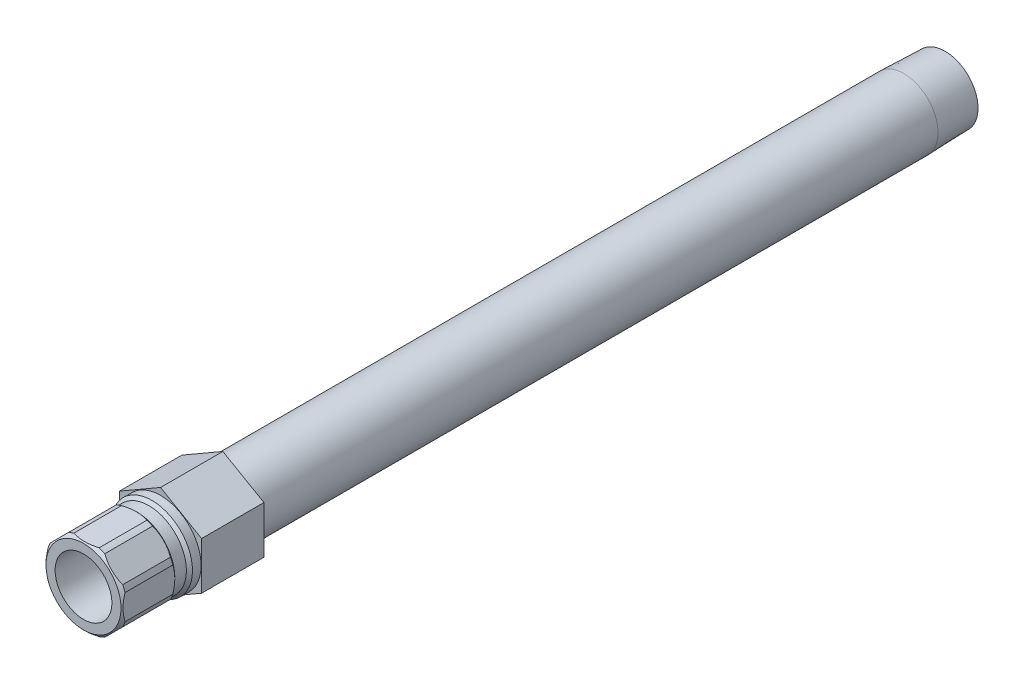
ISO-10303-21;
HEADER;
FILE_DESCRIPTION(('STEP AP214'),'2;1');
FILE_NAME('part.step','',(''),(''),'','','');
FILE_SCHEMA(('AUTOMOTIVE_DESIGN { 1 0 10303 214 1 1 1 1 }'));
ENDSEC;
DATA;
#1=APPLICATION_CONTEXT('core data for automotive mechanical design processes');
#2=APPLICATION_PROTOCOL_DEFINITION('international standard','automotive_design',2000,#1);
#3=PRODUCT_CONTEXT('',#1,'mechanical');
#4=PRODUCT('Part','Part','',(#3));
#5=PRODUCT_RELATED_PRODUCT_CATEGORY('part','',(#4));
#6=PRODUCT_DEFINITION_FORMATION('','',#4);
#7=PRODUCT_DEFINITION_CONTEXT('part definition',#1,'design');
#8=PRODUCT_DEFINITION('design','',#6,#7);
#9=PRODUCT_DEFINITION_SHAPE('','',#8);
#10=(LENGTH_UNIT() NAMED_UNIT(*) SI_UNIT(.MILLI.,.METRE.));
#11=(NAMED_UNIT(*) PLANE_ANGLE_UNIT() SI_UNIT($,.RADIAN.));
#12=(NAMED_UNIT(*) SI_UNIT($,.STERADIAN.) SOLID_ANGLE_UNIT());
#13=UNCERTAINTY_MEASURE_WITH_UNIT(LENGTH_MEASURE(1.E-05),#10,'distance_accuracy_value','');
#14=(GEOMETRIC_REPRESENTATION_CONTEXT(3) GLOBAL_UNCERTAINTY_ASSIGNED_CONTEXT((#13)) GLOBAL_UNIT_ASSIGNED_CONTEXT((#10,
#11,#12)) REPRESENTATION_CONTEXT('',''));
#15=CARTESIAN_POINT('',(0.,0.,0.));
#16=DIRECTION('',(0.,0.,1.));
#17=DIRECTION('',(1.,0.,0.));
#18=AXIS2_PLACEMENT_3D('',#15,#16,#17);
#19=CARTESIAN_POINT('',(0.,0.,0.));
#20=DIRECTION('',(0.,0.,-1.));
#21=DIRECTION('',(0.,1.,0.));
#22=AXIS2_PLACEMENT_3D('',#19,#20,#21);
#23=CYLINDRICAL_SURFACE('',#22,10.16);
#24=DIRECTION('',(0.,0.,-1.));
#25=VECTOR('',#24,1.);
#26=CARTESIAN_POINT('',(9.06826191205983,-4.58172739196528,0.));
#27=LINE('',#26,#25);
#28=CARTESIAN_POINT('',(9.06826191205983,-4.58172739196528,6.5786));
#29=VERTEX_POINT('',#28);
#30=CARTESIAN_POINT('',(9.06826191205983,-4.58172739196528,18.542));
#31=VERTEX_POINT('',#30);
#32=EDGE_CURVE('E525',#29,#31,#27,.F.);
#33=ORIENTED_EDGE('',*,*,#32,.F.);
#34=CARTESIAN_POINT('',(0.,0.,6.5786));
#35=DIRECTION('',(0.,0.,-1.));
#36=DIRECTION('',(0.,1.,0.));
#37=AXIS2_PLACEMENT_3D('',#34,#35,#36);
#38=CIRCLE('',#37,10.16);
#39=CARTESIAN_POINT('',(9.652,-3.17245898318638,6.5786));
#40=VERTEX_POINT('',#39);
#41=EDGE_CURVE('E216',#40,#29,#38,.T.);
#42=ORIENTED_EDGE('',*,*,#41,.F.);
#43=DIRECTION('',(0.,0.,-1.));
#44=VECTOR('',#43,1.);
#45=CARTESIAN_POINT('',(9.652,-3.17245898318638,0.));
#46=LINE('',#45,#44);
#47=CARTESIAN_POINT('',(9.652,-3.17245898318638,18.542));
#48=VERTEX_POINT('',#47);
#49=EDGE_CURVE('E404',#48,#40,#46,.T.);
#50=ORIENTED_EDGE('',*,*,#49,.F.);
#51=CARTESIAN_POINT('',(0.,0.,18.542));
#52=DIRECTION('',(0.,0.,-1.));
#53=DIRECTION('',(0.,1.,0.));
#54=AXIS2_PLACEMENT_3D('',#51,#52,#53);
#55=CIRCLE('',#54,10.16);
#56=EDGE_CURVE('E418',#48,#31,#55,.T.);
#57=ORIENTED_EDGE('',*,*,#56,.T.);
#58=EDGE_LOOP('',(#33,#42,#50,#57));
#59=FACE_BOUND('',#58,.T.);
#60=ADVANCED_FACE('F36',(#59),#23,.T.);
#61=DIRECTION('',(0.,0.,-1.));
#62=VECTOR('',#61,1.);
#63=CARTESIAN_POINT('',(9.652,3.17245898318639,0.));
#64=LINE('',#63,#62);
#65=CARTESIAN_POINT('',(9.652,3.1724589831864,6.57859999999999));
#66=VERTEX_POINT('',#65);
#67=CARTESIAN_POINT('',(9.652,3.17245898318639,18.542));
#68=VERTEX_POINT('',#67);
#69=EDGE_CURVE('E325',#66,#68,#64,.F.);
#70=ORIENTED_EDGE('',*,*,#69,.F.);
#71=CARTESIAN_POINT('',(9.06826191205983,4.58172739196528,6.5786));
#72=VERTEX_POINT('',#71);
#73=EDGE_CURVE('E219',#72,#66,#38,.T.);
#74=ORIENTED_EDGE('',*,*,#73,.F.);
#75=DIRECTION('',(0.,0.,-1.));
#76=VECTOR('',#75,1.);
#77=CARTESIAN_POINT('',(9.06826191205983,4.58172739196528,0.));
#78=LINE('',#77,#76);
#79=CARTESIAN_POINT('',(9.06826191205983,4.58172739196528,18.542));
#80=VERTEX_POINT('',#79);
#81=EDGE_CURVE('E397',#80,#72,#78,.T.);
#82=ORIENTED_EDGE('',*,*,#81,.F.);
#83=EDGE_CURVE('E233',#80,#68,#55,.T.);
#84=ORIENTED_EDGE('',*,*,#83,.T.);
#85=EDGE_LOOP('',(#70,#74,#82,#84));
#86=FACE_BOUND('',#85,.T.);
#87=ADVANCED_FACE('F419',(#86),#23,.T.);
#88=DIRECTION('',(0.,0.,-1.));
#89=VECTOR('',#88,1.);
#90=CARTESIAN_POINT('',(4.58172739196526,9.06826191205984,0.));
#91=LINE('',#90,#89);
#92=CARTESIAN_POINT('',(4.58172739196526,9.06826191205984,6.5786));
#93=VERTEX_POINT('',#92);
#94=CARTESIAN_POINT('',(4.58172739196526,9.06826191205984,18.542));
#95=VERTEX_POINT('',#94);
#96=EDGE_CURVE('E398',#93,#95,#91,.F.);
#97=ORIENTED_EDGE('',*,*,#96,.F.);
#98=CARTESIAN_POINT('',(3.17245898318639,9.652,6.5786));
#99=VERTEX_POINT('',#98);
#100=EDGE_CURVE('E221',#99,#93,#38,.T.);
#101=ORIENTED_EDGE('',*,*,#100,.F.);
#102=DIRECTION('',(0.,0.,-1.));
#103=VECTOR('',#102,1.);
#104=CARTESIAN_POINT('',(3.17245898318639,9.652,0.));
#105=LINE('',#104,#103);
#106=CARTESIAN_POINT('',(3.17245898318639,9.652,18.542));
#107=VERTEX_POINT('',#106);
#108=EDGE_CURVE('E391',#107,#99,#105,.T.);
#109=ORIENTED_EDGE('',*,*,#108,.F.);
#110=EDGE_CURVE('E229',#107,#95,#55,.T.);
#111=ORIENTED_EDGE('',*,*,#110,.T.);
#112=EDGE_LOOP('',(#97,#101,#109,#111));
#113=FACE_BOUND('',#112,.T.);
#114=ADVANCED_FACE('F438',(#113),#23,.T.);
#115=DIRECTION('',(0.,0.,-1.));
#116=VECTOR('',#115,1.);
#117=CARTESIAN_POINT('',(-3.17245898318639,9.652,0.));
#118=LINE('',#117,#116);
#119=CARTESIAN_POINT('',(-3.17245898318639,9.652,6.5786));
#120=VERTEX_POINT('',#119);
#121=CARTESIAN_POINT('',(-3.17245898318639,9.652,18.542));
#122=VERTEX_POINT('',#121);
#123=EDGE_CURVE('E392',#120,#122,#118,.F.);
#124=ORIENTED_EDGE('',*,*,#123,.F.);
#125=CARTESIAN_POINT('',(-4.58172739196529,9.06826191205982,6.5786));
#126=VERTEX_POINT('',#125);
#127=EDGE_CURVE('E226',#126,#120,#38,.T.);
#128=ORIENTED_EDGE('',*,*,#127,.F.);
#129=DIRECTION('',(0.,0.,-1.));
#130=VECTOR('',#129,1.);
#131=CARTESIAN_POINT('',(-4.58172739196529,9.06826191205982,0.));
#132=LINE('',#131,#130);
#133=CARTESIAN_POINT('',(-4.58172739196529,9.06826191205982,18.542));
#134=VERTEX_POINT('',#133);
#135=EDGE_CURVE('E56',#134,#126,#132,.T.);
#136=ORIENTED_EDGE('',*,*,#135,.F.);
#137=EDGE_CURVE('E225',#134,#122,#55,.T.);
#138=ORIENTED_EDGE('',*,*,#137,.T.);
#139=EDGE_LOOP('',(#124,#128,#136,#138));
#140=FACE_BOUND('',#139,.T.);
#141=ADVANCED_FACE('F433',(#140),#23,.T.);
#142=DIRECTION('',(0.,0.,-1.));
#143=VECTOR('',#142,1.);
#144=CARTESIAN_POINT('',(-9.06826191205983,4.58172739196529,0.));
#145=LINE('',#144,#143);
#146=CARTESIAN_POINT('',(-9.06826191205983,4.58172739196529,6.5786));
#147=VERTEX_POINT('',#146);
#148=CARTESIAN_POINT('',(-9.06826191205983,4.58172739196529,18.542));
#149=VERTEX_POINT('',#148);
#150=EDGE_CURVE('E388',#147,#149,#145,.F.);
#151=ORIENTED_EDGE('',*,*,#150,.F.);
#152=CARTESIAN_POINT('',(-9.652,3.17245898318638,6.5786));
#153=VERTEX_POINT('',#152);
#154=EDGE_CURVE('E441',#153,#147,#38,.T.);
#155=ORIENTED_EDGE('',*,*,#154,.F.);
#156=DIRECTION('',(0.,0.,-1.));
#157=VECTOR('',#156,1.);
#158=CARTESIAN_POINT('',(-9.652,3.17245898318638,0.));
#159=LINE('',#158,#157);
#160=CARTESIAN_POINT('',(-9.652,3.17245898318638,18.542));
#161=VERTEX_POINT('',#160);
#162=EDGE_CURVE('E64',#161,#153,#159,.T.);
#163=ORIENTED_EDGE('',*,*,#162,.F.);
#164=EDGE_CURVE('E424',#161,#149,#55,.T.);
#165=ORIENTED_EDGE('',*,*,#164,.T.);
#166=EDGE_LOOP('',(#151,#155,#163,#165));
#167=FACE_BOUND('',#166,.T.);
#168=ADVANCED_FACE('F546',(#167),#23,.T.);
#169=DIRECTION('',(0.,0.,-1.));
#170=VECTOR('',#169,1.);
#171=CARTESIAN_POINT('',(-9.652,-3.17245898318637,0.));
#172=LINE('',#171,#170);
#173=CARTESIAN_POINT('',(-9.652,-3.17245898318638,6.5786));
#174=VERTEX_POINT('',#173);
#175=CARTESIAN_POINT('',(-9.652,-3.17245898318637,18.542));
#176=VERTEX_POINT('',#175);
#177=EDGE_CURVE('E386',#174,#176,#172,.F.);
#178=ORIENTED_EDGE('',*,*,#177,.F.);
#179=CARTESIAN_POINT('',(-9.06826191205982,-4.58172739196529,6.5786));
#180=VERTEX_POINT('',#179);
#181=EDGE_CURVE('E220',#180,#174,#38,.T.);
#182=ORIENTED_EDGE('',*,*,#181,.F.);
#183=DIRECTION('',(0.,0.,-1.));
#184=VECTOR('',#183,1.);
#185=CARTESIAN_POINT('',(-9.06826191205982,-4.58172739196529,0.));
#186=LINE('',#185,#184);
#187=CARTESIAN_POINT('',(-9.06826191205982,-4.58172739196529,18.542));
#188=VERTEX_POINT('',#187);
#189=EDGE_CURVE('E263',#188,#180,#186,.T.);
#190=ORIENTED_EDGE('',*,*,#189,.F.);
#191=EDGE_CURVE('E422',#188,#176,#55,.T.);
#192=ORIENTED_EDGE('',*,*,#191,.T.);
#193=EDGE_LOOP('',(#178,#182,#190,#192));
#194=FACE_BOUND('',#193,.T.);
#195=ADVANCED_FACE('F539',(#194),#23,.T.);
#196=DIRECTION('',(0.,0.,-1.));
#197=VECTOR('',#196,1.);
#198=CARTESIAN_POINT('',(-4.58172739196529,-9.06826191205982,0.));
#199=LINE('',#198,#197);
#200=CARTESIAN_POINT('',(-4.58172739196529,-9.06826191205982,6.5786));
#201=VERTEX_POINT('',#200);
#202=CARTESIAN_POINT('',(-4.58172739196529,-9.06826191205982,18.542));
#203=VERTEX_POINT('',#202);
#204=EDGE_CURVE('E376',#201,#203,#199,.F.);
#205=ORIENTED_EDGE('',*,*,#204,.F.);
#206=CARTESIAN_POINT('',(-3.17245898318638,-9.652,6.5786));
#207=VERTEX_POINT('',#206);
#208=EDGE_CURVE('E217',#207,#201,#38,.T.);
#209=ORIENTED_EDGE('',*,*,#208,.F.);
#210=DIRECTION('',(0.,0.,-1.));
#211=VECTOR('',#210,1.);
#212=CARTESIAN_POINT('',(-3.17245898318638,-9.652,0.));
#213=LINE('',#212,#211);
#214=CARTESIAN_POINT('',(-3.17245898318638,-9.652,18.542));
#215=VERTEX_POINT('',#214);
#216=EDGE_CURVE('E194',#215,#207,#213,.T.);
#217=ORIENTED_EDGE('',*,*,#216,.F.);
#218=EDGE_CURVE('E385',#215,#203,#55,.T.);
#219=ORIENTED_EDGE('',*,*,#218,.T.);
#220=EDGE_LOOP('',(#205,#209,#217,#219));
#221=FACE_BOUND('',#220,.T.);
#222=ADVANCED_FACE('F383',(#221),#23,.T.);
#223=CARTESIAN_POINT('',(0.,0.,0.));
#224=DIRECTION('',(0.,0.,-1.));
#225=DIRECTION('',(0.,1.,0.));
#226=AXIS2_PLACEMENT_3D('',#223,#224,#225);
#227=CYLINDRICAL_SURFACE('',#226,8.5725);
#228=CARTESIAN_POINT('',(0.,0.,-186.2582));
#229=DIRECTION('',(0.,0.,-1.));
#230=DIRECTION('',(0.,1.,0.));
#231=AXIS2_PLACEMENT_3D('',#228,#229,#230);
#232=CIRCLE('',#231,8.5725);
#233=CARTESIAN_POINT('',(0.,8.5725,-186.2582));
#234=VERTEX_POINT('',#233);
#235=EDGE_CURVE('E456',#234,#234,#232,.T.);
#236=ORIENTED_EDGE('',*,*,#235,.F.);
#237=EDGE_LOOP('',(#236));
#238=FACE_BOUND('',#237,.T.);
#239=CARTESIAN_POINT('',(0.,0.,-15.621));
#240=DIRECTION('',(0.,0.,1.));
#241=DIRECTION('',(1.,0.,0.));
#242=AXIS2_PLACEMENT_3D('',#239,#240,#241);
#243=CIRCLE('',#242,8.5725);
#244=CARTESIAN_POINT('',(8.5725,0.,-15.621));
#245=VERTEX_POINT('',#244);
#246=EDGE_CURVE('E471',#245,#245,#243,.F.);
#247=ORIENTED_EDGE('',*,*,#246,.T.);
#248=EDGE_LOOP('',(#247));
#249=FACE_BOUND('',#248,.T.);
#250=ADVANCED_FACE('F538',(#238,#249),#227,.T.);
#251=CARTESIAN_POINT('',(0.,0.,0.));
#252=DIRECTION('',(0.,0.,-1.));
#253=DIRECTION('',(0.,1.,0.));
#254=AXIS2_PLACEMENT_3D('',#251,#252,#253);
#255=CYLINDRICAL_SURFACE('',#254,7.112);
#256=CARTESIAN_POINT('',(0.,0.,1.524));
#257=DIRECTION('',(0.,0.,-1.));
#258=DIRECTION('',(0.,1.,0.));
#259=AXIS2_PLACEMENT_3D('',#256,#257,#258);
#260=CIRCLE('',#259,7.112);
#261=CARTESIAN_POINT('',(0.,7.112,1.524));
#262=VERTEX_POINT('',#261);
#263=EDGE_CURVE('E468',#262,#262,#260,.T.);
#264=ORIENTED_EDGE('',*,*,#263,.T.);
#265=EDGE_LOOP('',(#264));
#266=FACE_BOUND('',#265,.T.);
#267=CARTESIAN_POINT('',(0.,0.,19.304));
#268=DIRECTION('',(0.,0.,-1.));
#269=DIRECTION('',(0.,1.,0.));
#270=AXIS2_PLACEMENT_3D('',#267,#268,#269);
#271=CIRCLE('',#270,7.112);
#272=CARTESIAN_POINT('',(0.,7.112,19.304));
#273=VERTEX_POINT('',#272);
#274=EDGE_CURVE('E200',#273,#273,#271,.T.);
#275=ORIENTED_EDGE('',*,*,#274,.F.);
#276=EDGE_LOOP('',(#275));
#277=FACE_BOUND('',#276,.T.);
#278=ADVANCED_FACE('F38',(#266,#277),#255,.F.);
#279=CARTESIAN_POINT('',(0.,7.112,19.304));
#280=DIRECTION('',(0.,0.,1.));
#281=DIRECTION('',(0.,-1.,0.));
#282=AXIS2_PLACEMENT_3D('',#279,#280,#281);
#283=PLANE('',#282);
#284=ORIENTED_EDGE('',*,*,#274,.T.);
#285=EDGE_LOOP('',(#284));
#286=FACE_BOUND('',#285,.T.);
#287=CARTESIAN_POINT('',(0.,0.,19.304));
#288=DIRECTION('',(0.,0.,-1.));
#289=DIRECTION('',(0.,1.,0.));
#290=AXIS2_PLACEMENT_3D('',#287,#288,#289);
#291=CIRCLE('',#290,9.398);
#292=CARTESIAN_POINT('',(0.,9.398,19.304));
#293=VERTEX_POINT('',#292);
#294=EDGE_CURVE('E232',#293,#293,#291,.T.);
#295=ORIENTED_EDGE('',*,*,#294,.F.);
#296=EDGE_LOOP('',(#295));
#297=FACE_BOUND('',#296,.T.);
#298=ADVANCED_FACE('F269',(#286,#297),#283,.T.);
#299=CARTESIAN_POINT('',(0.,0.,18.542));
#300=DIRECTION('',(0.,0.,-1.));
#301=DIRECTION('',(0.,1.,0.));
#302=AXIS2_PLACEMENT_3D('',#299,#300,#301);
#303=CONICAL_SURFACE('',#302,10.16,0.785398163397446);
#304=CARTESIAN_POINT('',(9.06871478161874,-4.58127452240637,18.5418));
#305=CARTESIAN_POINT('',(8.89746651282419,-4.75252279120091,18.6174888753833));
#306=CARTESIAN_POINT('',(8.72454398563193,-4.92544531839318,18.6860001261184));
#307=CARTESIAN_POINT('',(8.37571487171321,-5.2742744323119,18.8068689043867));
#308=CARTESIAN_POINT('',(8.19980528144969,-5.45018402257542,18.85920901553));
#309=CARTESIAN_POINT('',(7.8498282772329,-5.80016102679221,18.9447662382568));
#310=CARTESIAN_POINT('',(7.67581225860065,-5.97417704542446,18.9783973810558));
#311=CARTESIAN_POINT('',(7.32656572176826,-6.32342358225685,19.0270891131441));
#312=CARTESIAN_POINT('',(7.15133584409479,-6.49865345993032,19.0421588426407));
#313=CARTESIAN_POINT('',(6.77605057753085,-6.87393872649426,19.0538859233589));
#314=CARTESIAN_POINT('',(6.57594647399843,-7.07404283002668,19.0476773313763));
#315=CARTESIAN_POINT('',(6.17675989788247,-7.47322940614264,19.0106603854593));
#316=CARTESIAN_POINT('',(5.97767829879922,-7.67231100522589,18.9798336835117));
#317=CARTESIAN_POINT('',(5.57666706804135,-8.07332223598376,18.8939894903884));
#318=CARTESIAN_POINT('',(5.37480504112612,-8.27518426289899,18.8383431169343));
#319=CARTESIAN_POINT('',(5.07491153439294,-8.57507776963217,18.7386783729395));
#320=CARTESIAN_POINT('',(4.97548345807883,-8.67450584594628,18.7027814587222));
#321=CARTESIAN_POINT('',(4.77762502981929,-8.87236427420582,18.6259657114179));
#322=CARTESIAN_POINT('',(4.67919445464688,-8.97079484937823,18.5850480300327));
#323=CARTESIAN_POINT('',(4.58127452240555,-9.06871478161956,18.5417999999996));
#324=B_SPLINE_CURVE_WITH_KNOTS('',3,(#304,#305,#306,#307,#308,#309,#310,#311,#312,#313,#314,
#315,#316,#317,#318,#319,#320,#321,#322,#323),.UNSPECIFIED.,.F.,.F.,(4,2,2,2,2,2,2,2,2,4),(0.,
0.761268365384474,1.52335378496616,2.26782503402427,3.01192953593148,3.85997332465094,
4.70864975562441,5.58017277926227,6.01546212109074,6.4506517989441),.UNSPECIFIED.);
#325=CARTESIAN_POINT('',(4.58172739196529,-9.06826191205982,18.542));
#326=VERTEX_POINT('',#325);
#327=EDGE_CURVE('E506',#31,#326,#324,.T.);
#328=ORIENTED_EDGE('',*,*,#327,.F.);
#329=ORIENTED_EDGE('',*,*,#56,.F.);
#330=CARTESIAN_POINT('',(9.652,-7.71050187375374,16.3483388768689));
#331=CARTESIAN_POINT('',(9.652,-7.52475481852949,16.4642553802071));
#332=CARTESIAN_POINT('',(9.652,-7.33786285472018,16.5783624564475));
#333=CARTESIAN_POINT('',(9.652,-6.96152272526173,16.8023812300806));
#334=CARTESIAN_POINT('',(9.652,-6.77207395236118,16.9122919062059));
#335=CARTESIAN_POINT('',(9.652,-6.38961701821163,17.1277502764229));
#336=CARTESIAN_POINT('',(9.652,-6.19659699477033,17.2332770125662));
#337=CARTESIAN_POINT('',(9.652,-5.80760245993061,17.4386922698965));
#338=CARTESIAN_POINT('',(9.652,-5.6116281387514,17.5385811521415));
#339=CARTESIAN_POINT('',(9.652,-5.01021259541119,17.8328232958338));
#340=CARTESIAN_POINT('',(9.652,-4.59965798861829,18.0169416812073));
#341=CARTESIAN_POINT('',(9.652,-3.76461195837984,18.3488686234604));
#342=CARTESIAN_POINT('',(9.652,-3.34014745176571,18.4967430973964));
#343=CARTESIAN_POINT('',(9.652,-2.66836152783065,18.6905975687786));
#344=CARTESIAN_POINT('',(9.652,-2.42567962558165,18.7527238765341));
#345=CARTESIAN_POINT('',(9.652,-1.9366245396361,18.860517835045));
#346=CARTESIAN_POINT('',(9.652,-1.69025117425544,18.9061846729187));
#347=CARTESIAN_POINT('',(9.652,-1.1971622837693,18.9790662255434));
#348=CARTESIAN_POINT('',(9.652,-0.95047238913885,19.0064526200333));
#349=CARTESIAN_POINT('',(9.652,-0.45571021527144,19.0423990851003));
#350=CARTESIAN_POINT('',(9.652,-0.207637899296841,19.0509586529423));
#351=CARTESIAN_POINT('',(9.652,0.333683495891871,19.048681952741));
#352=CARTESIAN_POINT('',(9.652,0.626923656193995,19.0340251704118));
#353=CARTESIAN_POINT('',(9.652,1.21094277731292,18.9786837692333));
#354=CARTESIAN_POINT('',(9.652,1.501721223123,18.9379938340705));
#355=CARTESIAN_POINT('',(9.652,2.08266136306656,18.8320509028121));
#356=CARTESIAN_POINT('',(9.652,2.3727646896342,18.7664820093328));
#357=CARTESIAN_POINT('',(9.652,2.94714147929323,18.6138865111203));
#358=CARTESIAN_POINT('',(9.652,3.23141585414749,18.5268632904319));
#359=CARTESIAN_POINT('',(9.652,3.82869981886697,18.3226103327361));
#360=CARTESIAN_POINT('',(9.652,4.14087760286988,18.2029681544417));
#361=CARTESIAN_POINT('',(9.652,4.75742701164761,17.9448741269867));
#362=CARTESIAN_POINT('',(9.652,5.0617950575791,17.8064138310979));
#363=CARTESIAN_POINT('',(9.652,5.66409479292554,17.5139015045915));
#364=CARTESIAN_POINT('',(9.652,5.96200267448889,17.3598008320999));
#365=CARTESIAN_POINT('',(9.652,6.55107386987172,17.0393844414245));
#366=CARTESIAN_POINT('',(9.652,6.84223818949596,16.8730705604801));
#367=CARTESIAN_POINT('',(9.652,7.40668231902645,16.5376791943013));
#368=CARTESIAN_POINT('',(9.652,7.68020242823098,16.3690040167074));
#369=CARTESIAN_POINT('',(9.652,8.22250898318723,16.0241853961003));
#370=CARTESIAN_POINT('',(9.652,8.49129505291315,15.848041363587));
#371=CARTESIAN_POINT('',(9.652,9.02258177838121,15.4910339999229));
#372=CARTESIAN_POINT('',(9.652,9.28511552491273,15.3102197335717));
#373=CARTESIAN_POINT('',(9.652,9.80652727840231,14.9435456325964));
#374=CARTESIAN_POINT('',(9.652,10.0654063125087,14.7576872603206));
#375=CARTESIAN_POINT('',(9.652,10.3227473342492,14.5697596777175));
#376=B_SPLINE_CURVE_WITH_KNOTS('',3,(#330,#331,#332,#333,#334,#335,#336,#337,#338,#339,#340,
#341,#342,#343,#344,#345,#346,#347,#348,#349,#350,#351,#352,#353,#354,#355,#356,#357,#358,#359,
#360,#361,#362,#363,#364,#365,#366,#367,#368,#369,#370,#371,#372,#373,#374,#375),.UNSPECIFIED.,
.F.,.F.,(4,2,2,2,2,2,2,2,2,2,2,2,2,2,2,2,2,2,2,2,2,2,4),(0.,0.656855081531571,1.31386901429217,
1.97372850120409,2.63354568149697,3.98211483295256,5.32821282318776,6.07925616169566,
6.83033658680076,7.5742601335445,8.31820354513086,9.1977741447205,10.0775244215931,
10.9688407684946,11.8600166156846,12.8622077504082,13.8648502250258,14.8707124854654,
15.8764237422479,16.8403261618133,17.8043048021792,18.7605668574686,19.7165545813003),.UNSPECIFIED.);
#377=EDGE_CURVE('E317',#68,#48,#376,.F.);
#378=ORIENTED_EDGE('',*,*,#377,.F.);
#379=ORIENTED_EDGE('',*,*,#83,.F.);
#380=CARTESIAN_POINT('',(4.58127452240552,9.06871478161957,18.5417999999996));
#381=CARTESIAN_POINT('',(4.75252279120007,8.89746651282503,18.617488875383));
#382=CARTESIAN_POINT('',(4.92544531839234,8.72454398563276,18.6860001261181));
#383=CARTESIAN_POINT('',(5.27427443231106,8.37571487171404,18.8068689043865));
#384=CARTESIAN_POINT('',(5.45018402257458,8.19980528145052,18.8592090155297));
#385=CARTESIAN_POINT('',(5.80016102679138,7.84982827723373,18.9447662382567));
#386=CARTESIAN_POINT('',(5.97417704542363,7.67581225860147,18.9783973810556));
#387=CARTESIAN_POINT('',(6.32342358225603,7.32656572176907,19.027089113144));
#388=CARTESIAN_POINT('',(6.4986534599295,7.1513358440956,19.0421588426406));
#389=CARTESIAN_POINT('',(6.87393872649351,6.77605057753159,19.0538859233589));
#390=CARTESIAN_POINT('',(7.074042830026,6.57594647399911,19.0476773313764));
#391=CARTESIAN_POINT('',(7.4732294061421,6.17675989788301,19.0106603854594));
#392=CARTESIAN_POINT('',(7.67231100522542,5.97767829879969,18.9798336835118));
#393=CARTESIAN_POINT('',(8.07332223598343,5.57666706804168,18.8939894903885));
#394=CARTESIAN_POINT('',(8.27518426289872,5.37480504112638,18.8383431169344));
#395=CARTESIAN_POINT('',(8.57507776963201,5.07491153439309,18.7386783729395));
#396=CARTESIAN_POINT('',(8.67450584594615,4.97548345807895,18.7027814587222));
#397=CARTESIAN_POINT('',(8.87236427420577,4.77762502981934,18.6259657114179));
#398=CARTESIAN_POINT('',(8.9707948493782,4.6791944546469,18.5850480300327));
#399=CARTESIAN_POINT('',(9.06871478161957,4.58127452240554,18.5417999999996));
#400=B_SPLINE_CURVE_WITH_KNOTS('',3,(#380,#381,#382,#383,#384,#385,#386,#387,#388,#389,#390,
#391,#392,#393,#394,#395,#396,#397,#398,#399),.UNSPECIFIED.,.F.,.F.,(4,2,2,2,2,2,2,2,2,4),(0.,
0.761268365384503,1.52335378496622,2.26782503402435,3.01192953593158,3.85997332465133,
4.70864975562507,5.58017277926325,6.01546212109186,6.45065179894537),.UNSPECIFIED.);
#401=EDGE_CURVE('E309',#95,#80,#400,.T.);
#402=ORIENTED_EDGE('',*,*,#401,.F.);
#403=ORIENTED_EDGE('',*,*,#110,.F.);
#404=CARTESIAN_POINT('',(-7.71050187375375,9.652,16.3483388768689));
#405=CARTESIAN_POINT('',(-7.5247548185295,9.652,16.4642553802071));
#406=CARTESIAN_POINT('',(-7.33786285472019,9.652,16.5783624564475));
#407=CARTESIAN_POINT('',(-6.96152272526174,9.652,16.8023812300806));
#408=CARTESIAN_POINT('',(-6.77207395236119,9.652,16.9122919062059));
#409=CARTESIAN_POINT('',(-6.38961701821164,9.652,17.1277502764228));
#410=CARTESIAN_POINT('',(-6.19659699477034,9.652,17.2332770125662));
#411=CARTESIAN_POINT('',(-5.80760245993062,9.652,17.4386922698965));
#412=CARTESIAN_POINT('',(-5.61162813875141,9.652,17.5385811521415));
#413=CARTESIAN_POINT('',(-5.0102125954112,9.652,17.8328232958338));
#414=CARTESIAN_POINT('',(-4.5996579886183,9.652,18.0169416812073));
#415=CARTESIAN_POINT('',(-3.76461195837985,9.652,18.3488686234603));
#416=CARTESIAN_POINT('',(-3.34014745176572,9.652,18.4967430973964));
#417=CARTESIAN_POINT('',(-2.66836152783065,9.652,18.6905975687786));
#418=CARTESIAN_POINT('',(-2.42567962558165,9.652,18.7527238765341));
#419=CARTESIAN_POINT('',(-1.9366245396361,9.652,18.860517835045));
#420=CARTESIAN_POINT('',(-1.69025117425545,9.652,18.9061846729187));
#421=CARTESIAN_POINT('',(-1.19716228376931,9.652,18.9790662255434));
#422=CARTESIAN_POINT('',(-0.950472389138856,9.652,19.0064526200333));
#423=CARTESIAN_POINT('',(-0.455710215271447,9.652,19.0423990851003));
#424=CARTESIAN_POINT('',(-0.207637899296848,9.652,19.0509586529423));
#425=CARTESIAN_POINT('',(0.333683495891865,9.652,19.048681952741));
#426=CARTESIAN_POINT('',(0.626923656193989,9.652,19.0340251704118));
#427=CARTESIAN_POINT('',(1.21094277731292,9.652,18.9786837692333));
#428=CARTESIAN_POINT('',(1.50172122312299,9.652,18.9379938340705));
#429=CARTESIAN_POINT('',(2.08266136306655,9.652,18.8320509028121));
#430=CARTESIAN_POINT('',(2.3727646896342,9.652,18.7664820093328));
#431=CARTESIAN_POINT('',(2.94714147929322,9.652,18.6138865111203));
#432=CARTESIAN_POINT('',(3.23141585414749,9.652,18.5268632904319));
#433=CARTESIAN_POINT('',(3.82869981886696,9.652,18.3226103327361));
#434=CARTESIAN_POINT('',(4.14087760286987,9.652,18.2029681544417));
#435=CARTESIAN_POINT('',(4.7574270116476,9.652,17.9448741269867));
#436=CARTESIAN_POINT('',(5.06179505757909,9.652,17.8064138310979));
#437=CARTESIAN_POINT('',(5.66409479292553,9.652,17.5139015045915));
#438=CARTESIAN_POINT('',(5.96200267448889,9.652,17.3598008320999));
#439=CARTESIAN_POINT('',(6.55107386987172,9.652,17.0393844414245));
#440=CARTESIAN_POINT('',(6.84223818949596,9.652,16.8730705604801));
#441=CARTESIAN_POINT('',(7.40668231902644,9.652,16.5376791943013));
#442=CARTESIAN_POINT('',(7.68020242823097,9.652,16.3690040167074));
#443=CARTESIAN_POINT('',(8.22250898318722,9.652,16.0241853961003));
#444=CARTESIAN_POINT('',(8.49129505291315,9.652,15.848041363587));
#445=CARTESIAN_POINT('',(9.0225817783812,9.652,15.4910339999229));
#446=CARTESIAN_POINT('',(9.28511552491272,9.652,15.3102197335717));
#447=CARTESIAN_POINT('',(9.8065272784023,9.652,14.9435456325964));
#448=CARTESIAN_POINT('',(10.0654063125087,9.652,14.7576872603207));
#449=CARTESIAN_POINT('',(10.3227473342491,9.652,14.5697596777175));
#450=B_SPLINE_CURVE_WITH_KNOTS('',3,(#404,#405,#406,#407,#408,#409,#410,#411,#412,#413,#414,
#415,#416,#417,#418,#419,#420,#421,#422,#423,#424,#425,#426,#427,#428,#429,#430,#431,#432,#433,
#434,#435,#436,#437,#438,#439,#440,#441,#442,#443,#444,#445,#446,#447,#448,#449),.UNSPECIFIED.,
.F.,.F.,(4,2,2,2,2,2,2,2,2,2,2,2,2,2,2,2,2,2,2,2,2,2,4),(0.,0.656855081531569,1.31386901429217,
1.97372850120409,2.63354568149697,3.98211483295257,5.32821282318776,6.07925616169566,
6.83033658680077,7.57426013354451,8.31820354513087,9.1977741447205,10.0775244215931,
10.9688407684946,11.8600166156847,12.8622077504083,13.8648502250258,14.8707124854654,
15.8764237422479,16.8403261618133,17.8043048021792,18.7605668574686,19.7165545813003),.UNSPECIFIED.);
#451=EDGE_CURVE('E301',#122,#107,#450,.T.);
#452=ORIENTED_EDGE('',*,*,#451,.F.);
#453=ORIENTED_EDGE('',*,*,#137,.F.);
#454=CARTESIAN_POINT('',(-9.06871478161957,4.58127452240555,18.5417999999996));
#455=CARTESIAN_POINT('',(-8.89746651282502,4.75252279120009,18.617488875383));
#456=CARTESIAN_POINT('',(-8.72454398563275,4.92544531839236,18.6860001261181));
#457=CARTESIAN_POINT('',(-8.37571487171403,5.27427443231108,18.8068689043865));
#458=CARTESIAN_POINT('',(-8.19980528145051,5.4501840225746,18.8592090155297));
#459=CARTESIAN_POINT('',(-7.84982827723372,5.80016102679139,18.9447662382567));
#460=CARTESIAN_POINT('',(-7.67581225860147,5.97417704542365,18.9783973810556));
#461=CARTESIAN_POINT('',(-7.32656572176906,6.32342358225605,19.027089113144));
#462=CARTESIAN_POINT('',(-7.15133584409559,6.49865345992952,19.0421588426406));
#463=CARTESIAN_POINT('',(-6.77605057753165,6.87393872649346,19.0538859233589));
#464=CARTESIAN_POINT('',(-6.57594647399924,7.07404283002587,19.0476773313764));
#465=CARTESIAN_POINT('',(-6.17675989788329,7.47322940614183,19.0106603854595));
#466=CARTESIAN_POINT('',(-5.97767829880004,7.67231100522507,18.9798336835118));
#467=CARTESIAN_POINT('',(-5.57666706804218,8.07332223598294,18.8939894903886));
#468=CARTESIAN_POINT('',(-5.37480504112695,8.27518426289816,18.8383431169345));
#469=CARTESIAN_POINT('',(-5.07491153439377,8.57507776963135,18.7386783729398));
#470=CARTESIAN_POINT('',(-4.97548345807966,8.67450584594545,18.7027814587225));
#471=CARTESIAN_POINT('',(-4.77762502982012,8.872364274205,18.6259657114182));
#472=CARTESIAN_POINT('',(-4.67919445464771,8.9707948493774,18.585048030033));
#473=CARTESIAN_POINT('',(-4.58127452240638,9.06871478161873,18.5418));
#474=B_SPLINE_CURVE_WITH_KNOTS('',3,(#454,#455,#456,#457,#458,#459,#460,#461,#462,#463,#464,
#465,#466,#467,#468,#469,#470,#471,#472,#473),.UNSPECIFIED.,.F.,.F.,(4,2,2,2,2,2,2,2,2,4),(0.,
0.761268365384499,1.52335378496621,2.26782503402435,3.01192953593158,3.85997332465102,
4.70864975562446,5.5801727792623,6.01546212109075,6.4506517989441),.UNSPECIFIED.);
#475=EDGE_CURVE('E292',#149,#134,#474,.T.);
#476=ORIENTED_EDGE('',*,*,#475,.F.);
#477=ORIENTED_EDGE('',*,*,#164,.F.);
#478=CARTESIAN_POINT('',(-9.652,-7.71050187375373,16.3483388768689));
#479=CARTESIAN_POINT('',(-9.652,-7.52475481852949,16.4642553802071));
#480=CARTESIAN_POINT('',(-9.652,-7.33786285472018,16.5783624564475));
#481=CARTESIAN_POINT('',(-9.652,-6.96152272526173,16.8023812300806));
#482=CARTESIAN_POINT('',(-9.652,-6.77207395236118,16.9122919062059));
#483=CARTESIAN_POINT('',(-9.652,-6.38961701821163,17.1277502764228));
#484=CARTESIAN_POINT('',(-9.652,-6.19659699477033,17.2332770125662));
#485=CARTESIAN_POINT('',(-9.652,-5.8076024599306,17.4386922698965));
#486=CARTESIAN_POINT('',(-9.652,-5.6116281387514,17.5385811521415));
#487=CARTESIAN_POINT('',(-9.652,-5.01021259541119,17.8328232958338));
#488=CARTESIAN_POINT('',(-9.652,-4.59965798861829,18.0169416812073));
#489=CARTESIAN_POINT('',(-9.652,-3.76461195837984,18.3488686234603));
#490=CARTESIAN_POINT('',(-9.652,-3.34014745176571,18.4967430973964));
#491=CARTESIAN_POINT('',(-9.652,-2.66836152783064,18.6905975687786));
#492=CARTESIAN_POINT('',(-9.652,-2.42567962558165,18.7527238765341));
#493=CARTESIAN_POINT('',(-9.652,-1.9366245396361,18.860517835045));
#494=CARTESIAN_POINT('',(-9.652,-1.69025117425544,18.9061846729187));
#495=CARTESIAN_POINT('',(-9.652,-1.1971622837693,18.9790662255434));
#496=CARTESIAN_POINT('',(-9.652,-0.950472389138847,19.0064526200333));
#497=CARTESIAN_POINT('',(-9.652,-0.455710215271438,19.0423990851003));
#498=CARTESIAN_POINT('',(-9.652,-0.207637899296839,19.0509586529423));
#499=CARTESIAN_POINT('',(-9.652,0.333683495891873,19.048681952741));
#500=CARTESIAN_POINT('',(-9.652,0.626923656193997,19.0340251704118));
#501=CARTESIAN_POINT('',(-9.652,1.21094277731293,18.9786837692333));
#502=CARTESIAN_POINT('',(-9.652,1.501721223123,18.9379938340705));
#503=CARTESIAN_POINT('',(-9.652,2.08266136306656,18.8320509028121));
#504=CARTESIAN_POINT('',(-9.652,2.3727646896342,18.7664820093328));
#505=CARTESIAN_POINT('',(-9.652,2.94714147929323,18.6138865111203));
#506=CARTESIAN_POINT('',(-9.652,3.23141585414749,18.5268632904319));
#507=CARTESIAN_POINT('',(-9.652,3.82869981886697,18.3226103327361));
#508=CARTESIAN_POINT('',(-9.652,4.14087760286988,18.2029681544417));
#509=CARTESIAN_POINT('',(-9.652,4.75742701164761,17.9448741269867));
#510=CARTESIAN_POINT('',(-9.652,5.0617950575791,17.8064138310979));
#511=CARTESIAN_POINT('',(-9.652,5.66409479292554,17.5139015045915));
#512=CARTESIAN_POINT('',(-9.652,5.9620026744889,17.3598008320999));
#513=CARTESIAN_POINT('',(-9.652,6.55107386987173,17.0393844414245));
#514=CARTESIAN_POINT('',(-9.652,6.84223818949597,16.8730705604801));
#515=CARTESIAN_POINT('',(-9.652,7.40668231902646,16.5376791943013));
#516=CARTESIAN_POINT('',(-9.652,7.68020242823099,16.3690040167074));
#517=CARTESIAN_POINT('',(-9.652,8.22250898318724,16.0241853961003));
#518=CARTESIAN_POINT('',(-9.652,8.49129505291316,15.848041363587));
#519=CARTESIAN_POINT('',(-9.652,9.02258177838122,15.4910339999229));
#520=CARTESIAN_POINT('',(-9.652,9.28511552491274,15.3102197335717));
#521=CARTESIAN_POINT('',(-9.652,9.80652727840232,14.9435456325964));
#522=CARTESIAN_POINT('',(-9.652,10.0654063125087,14.7576872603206));
#523=CARTESIAN_POINT('',(-9.652,10.3227473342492,14.5697596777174));
#524=B_SPLINE_CURVE_WITH_KNOTS('',3,(#478,#479,#480,#481,#482,#483,#484,#485,#486,#487,#488,
#489,#490,#491,#492,#493,#494,#495,#496,#497,#498,#499,#500,#501,#502,#503,#504,#505,#506,#507,
#508,#509,#510,#511,#512,#513,#514,#515,#516,#517,#518,#519,#520,#521,#522,#523),.UNSPECIFIED.,
.F.,.F.,(4,2,2,2,2,2,2,2,2,2,2,2,2,2,2,2,2,2,2,2,2,2,4),(0.,0.656855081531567,1.31386901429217,
1.97372850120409,2.63354568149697,3.98211483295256,5.32821282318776,6.07925616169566,
6.83033658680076,7.5742601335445,8.31820354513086,9.1977741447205,10.0775244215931,
10.9688407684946,11.8600166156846,12.8622077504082,13.8648502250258,14.8707124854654,
15.8764237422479,16.8403261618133,17.8043048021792,18.7605668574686,19.7165545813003),.UNSPECIFIED.);
#525=EDGE_CURVE('E284',#176,#161,#524,.T.);
#526=ORIENTED_EDGE('',*,*,#525,.F.);
#527=ORIENTED_EDGE('',*,*,#191,.F.);
#528=CARTESIAN_POINT('',(-4.58127452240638,-9.06871478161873,18.5418));
#529=CARTESIAN_POINT('',(-4.75252279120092,-8.89746651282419,18.6174888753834));
#530=CARTESIAN_POINT('',(-4.92544531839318,-8.72454398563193,18.6860001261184));
#531=CARTESIAN_POINT('',(-5.2742744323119,-8.37571487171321,18.8068689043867));
#532=CARTESIAN_POINT('',(-5.45018402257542,-8.19980528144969,18.85920901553));
#533=CARTESIAN_POINT('',(-5.80016102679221,-7.8498282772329,18.9447662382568));
#534=CARTESIAN_POINT('',(-5.97417704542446,-7.67581225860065,18.9783973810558));
#535=CARTESIAN_POINT('',(-6.32342358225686,-7.32656572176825,19.0270891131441));
#536=CARTESIAN_POINT('',(-6.49865345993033,-7.15133584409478,19.0421588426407));
#537=CARTESIAN_POINT('',(-6.87393872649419,-6.77605057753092,19.0538859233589));
#538=CARTESIAN_POINT('',(-7.07404283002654,-6.57594647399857,19.0476773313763));
#539=CARTESIAN_POINT('',(-7.47322940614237,-6.17675989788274,19.0106603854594));
#540=CARTESIAN_POINT('',(-7.67231100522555,-5.97767829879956,18.9798336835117));
#541=CARTESIAN_POINT('',(-8.07332223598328,-5.57666706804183,18.8939894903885));
#542=CARTESIAN_POINT('',(-8.27518426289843,-5.37480504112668,18.8383431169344));
#543=CARTESIAN_POINT('',(-8.57507776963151,-5.0749115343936,18.7386783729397));
#544=CARTESIAN_POINT('',(-8.67450584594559,-4.97548345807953,18.7027814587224));
#545=CARTESIAN_POINT('',(-8.87236427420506,-4.77762502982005,18.6259657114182));
#546=CARTESIAN_POINT('',(-8.97079484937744,-4.67919445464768,18.585048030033));
#547=CARTESIAN_POINT('',(-9.06871478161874,-4.58127452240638,18.5418));
#548=B_SPLINE_CURVE_WITH_KNOTS('',3,(#528,#529,#530,#531,#532,#533,#534,#535,#536,#537,#538,
#539,#540,#541,#542,#543,#544,#545,#546,#547),.UNSPECIFIED.,.F.,.F.,(4,2,2,2,2,2,2,2,2,4),(0.,
0.761268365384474,1.52335378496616,2.26782503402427,3.01192953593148,3.85997332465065,
4.70864975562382,5.58017277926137,6.01546212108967,6.45065179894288),.UNSPECIFIED.);
#549=EDGE_CURVE('E277',#203,#188,#548,.T.);
#550=ORIENTED_EDGE('',*,*,#549,.F.);
#551=ORIENTED_EDGE('',*,*,#218,.F.);
#552=CARTESIAN_POINT('',(-7.71050187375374,-9.652,16.3483388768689));
#553=CARTESIAN_POINT('',(-7.52475481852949,-9.652,16.4642553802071));
#554=CARTESIAN_POINT('',(-7.33786285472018,-9.652,16.5783624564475));
#555=CARTESIAN_POINT('',(-6.96152272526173,-9.652,16.8023812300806));
#556=CARTESIAN_POINT('',(-6.77207395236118,-9.652,16.9122919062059));
#557=CARTESIAN_POINT('',(-6.38961701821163,-9.652,17.1277502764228));
#558=CARTESIAN_POINT('',(-6.19659699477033,-9.652,17.2332770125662));
#559=CARTESIAN_POINT('',(-5.80760245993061,-9.652,17.4386922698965));
#560=CARTESIAN_POINT('',(-5.6116281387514,-9.652,17.5385811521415));
#561=CARTESIAN_POINT('',(-5.01021259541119,-9.652,17.8328232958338));
#562=CARTESIAN_POINT('',(-4.59965798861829,-9.652,18.0169416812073));
#563=CARTESIAN_POINT('',(-3.76461195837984,-9.652,18.3488686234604));
#564=CARTESIAN_POINT('',(-3.34014745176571,-9.652,18.4967430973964));
#565=CARTESIAN_POINT('',(-2.66836152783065,-9.652,18.6905975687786));
#566=CARTESIAN_POINT('',(-2.42567962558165,-9.652,18.7527238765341));
#567=CARTESIAN_POINT('',(-1.9366245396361,-9.652,18.860517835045));
#568=CARTESIAN_POINT('',(-1.69025117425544,-9.652,18.9061846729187));
#569=CARTESIAN_POINT('',(-1.1971622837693,-9.652,18.9790662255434));
#570=CARTESIAN_POINT('',(-0.950472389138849,-9.652,19.0064526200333));
#571=CARTESIAN_POINT('',(-0.45571021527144,-9.652,19.0423990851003));
#572=CARTESIAN_POINT('',(-0.20763789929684,-9.652,19.0509586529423));
#573=CARTESIAN_POINT('',(0.333683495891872,-9.652,19.048681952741));
#574=CARTESIAN_POINT('',(0.626923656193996,-9.652,19.0340251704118));
#575=CARTESIAN_POINT('',(1.21094277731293,-9.652,18.9786837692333));
#576=CARTESIAN_POINT('',(1.501721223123,-9.652,18.9379938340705));
#577=CARTESIAN_POINT('',(2.08266136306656,-9.652,18.8320509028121));
#578=CARTESIAN_POINT('',(2.3727646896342,-9.652,18.7664820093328));
#579=CARTESIAN_POINT('',(2.94714147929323,-9.652,18.6138865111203));
#580=CARTESIAN_POINT('',(3.23141585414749,-9.652,18.5268632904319));
#581=CARTESIAN_POINT('',(3.82869981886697,-9.652,18.3226103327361));
#582=CARTESIAN_POINT('',(4.14087760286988,-9.652,18.2029681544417));
#583=CARTESIAN_POINT('',(4.75742701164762,-9.652,17.9448741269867));
#584=CARTESIAN_POINT('',(5.0617950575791,-9.652,17.8064138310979));
#585=CARTESIAN_POINT('',(5.66409479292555,-9.652,17.5139015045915));
#586=CARTESIAN_POINT('',(5.9620026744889,-9.652,17.3598008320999));
#587=CARTESIAN_POINT('',(6.55107386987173,-9.652,17.0393844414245));
#588=CARTESIAN_POINT('',(6.84223818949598,-9.652,16.8730705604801));
#589=CARTESIAN_POINT('',(7.40668231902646,-9.652,16.5376791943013));
#590=CARTESIAN_POINT('',(7.68020242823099,-9.652,16.3690040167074));
#591=CARTESIAN_POINT('',(8.22250898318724,-9.652,16.0241853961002));
#592=CARTESIAN_POINT('',(8.49129505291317,-9.652,15.848041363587));
#593=CARTESIAN_POINT('',(9.02258177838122,-9.652,15.4910339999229));
#594=CARTESIAN_POINT('',(9.28511552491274,-9.652,15.3102197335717));
#595=CARTESIAN_POINT('',(9.80652727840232,-9.652,14.9435456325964));
#596=CARTESIAN_POINT('',(10.0654063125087,-9.652,14.7576872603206));
#597=CARTESIAN_POINT('',(10.3227473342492,-9.652,14.5697596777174));
#598=B_SPLINE_CURVE_WITH_KNOTS('',3,(#552,#553,#554,#555,#556,#557,#558,#559,#560,#561,#562,
#563,#564,#565,#566,#567,#568,#569,#570,#571,#572,#573,#574,#575,#576,#577,#578,#579,#580,#581,
#582,#583,#584,#585,#586,#587,#588,#589,#590,#591,#592,#593,#594,#595,#596,#597),.UNSPECIFIED.,
.F.,.F.,(4,2,2,2,2,2,2,2,2,2,2,2,2,2,2,2,2,2,2,2,2,2,4),(0.,0.656855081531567,1.31386901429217,
1.97372850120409,2.63354568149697,3.98211483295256,5.32821282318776,6.07925616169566,
6.83033658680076,7.5742601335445,8.31820354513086,9.1977741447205,10.0775244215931,
10.9688407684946,11.8600166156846,12.8622077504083,13.8648502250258,14.8707124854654,
15.8764237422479,16.8403261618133,17.8043048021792,18.7605668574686,19.7165545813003),.UNSPECIFIED.);
#599=CARTESIAN_POINT('',(3.17245898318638,-9.652,18.542));
#600=VERTEX_POINT('',#599);
#601=EDGE_CURVE('E210',#600,#215,#598,.F.);
#602=ORIENTED_EDGE('',*,*,#601,.F.);
#603=EDGE_CURVE('E209',#326,#600,#55,.T.);
#604=ORIENTED_EDGE('',*,*,#603,.F.);
#605=EDGE_LOOP('',(#328,#329,#378,#379,#402,#403,#452,#453,#476,#477,#526,#527,#550,#551,#602,#604));
#606=FACE_BOUND('',#605,.T.);
#607=ORIENTED_EDGE('',*,*,#294,.T.);
#608=EDGE_LOOP('',(#607));
#609=FACE_BOUND('',#608,.T.);
#610=ADVANCED_FACE('F266',(#606,#609),#303,.T.);
#611=DIRECTION('',(0.,0.,-1.));
#612=VECTOR('',#611,1.);
#613=CARTESIAN_POINT('',(4.58172739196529,-9.06826191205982,0.));
#614=LINE('',#613,#612);
#615=CARTESIAN_POINT('',(4.58172739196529,-9.06826191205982,6.5786));
#616=VERTEX_POINT('',#615);
#617=EDGE_CURVE('E324',#326,#616,#614,.T.);
#618=ORIENTED_EDGE('',*,*,#617,.F.);
#619=ORIENTED_EDGE('',*,*,#603,.T.);
#620=DIRECTION('',(0.,0.,-1.));
#621=VECTOR('',#620,1.);
#622=CARTESIAN_POINT('',(3.17245898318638,-9.652,0.));
#623=LINE('',#622,#621);
#624=CARTESIAN_POINT('',(3.1724589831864,-9.652,6.57859999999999));
#625=VERTEX_POINT('',#624);
#626=EDGE_CURVE('E191',#625,#600,#623,.F.);
#627=ORIENTED_EDGE('',*,*,#626,.F.);
#628=EDGE_CURVE('E207',#616,#625,#38,.T.);
#629=ORIENTED_EDGE('',*,*,#628,.F.);
#630=EDGE_LOOP('',(#618,#619,#627,#629));
#631=FACE_BOUND('',#630,.T.);
#632=ADVANCED_FACE('F206',(#631),#23,.T.);
#633=CARTESIAN_POINT('',(0.,0.,5.8166));
#634=DIRECTION('',(0.,0.,1.));
#635=DIRECTION('',(0.,-1.,0.));
#636=AXIS2_PLACEMENT_3D('',#633,#634,#635);
#637=CONICAL_SURFACE('',#636,9.398,0.785398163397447);
#638=CARTESIAN_POINT('',(4.58127452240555,-9.06871478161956,6.57880000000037));
#639=CARTESIAN_POINT('',(4.75252279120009,-8.89746651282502,6.50311112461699));
#640=CARTESIAN_POINT('',(4.92544531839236,-8.72454398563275,6.4345998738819));
#641=CARTESIAN_POINT('',(5.27427443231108,-8.37571487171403,6.31373109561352));
#642=CARTESIAN_POINT('',(5.4501840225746,-8.19980528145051,6.26139098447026));
#643=CARTESIAN_POINT('',(5.8001610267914,-7.84982827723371,6.17583376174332));
#644=CARTESIAN_POINT('',(5.97417704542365,-7.67581225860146,6.14220261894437));
#645=CARTESIAN_POINT('',(6.32342358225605,-7.32656572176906,6.09351088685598));
#646=CARTESIAN_POINT('',(6.49865345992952,-7.15133584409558,6.07844115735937));
#647=CARTESIAN_POINT('',(6.87393872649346,-6.77605057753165,6.06671407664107));
#648=CARTESIAN_POINT('',(7.07404283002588,-6.57594647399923,6.07292266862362));
#649=CARTESIAN_POINT('',(7.47322940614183,-6.17675989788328,6.10993961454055));
#650=CARTESIAN_POINT('',(7.67231100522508,-5.97767829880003,6.14076631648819));
#651=CARTESIAN_POINT('',(8.07332223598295,-5.57666706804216,6.22661050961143));
#652=CARTESIAN_POINT('',(8.27518426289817,-5.37480504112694,6.28225688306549));
#653=CARTESIAN_POINT('',(8.57507776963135,-5.07491153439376,6.38192162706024));
#654=CARTESIAN_POINT('',(8.67450584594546,-4.97548345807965,6.41781854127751));
#655=CARTESIAN_POINT('',(8.872364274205,-4.77762502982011,6.49463428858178));
#656=CARTESIAN_POINT('',(8.97079484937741,-4.6791944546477,6.53555196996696));
#657=CARTESIAN_POINT('',(9.06871478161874,-4.58127452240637,6.5788));
#658=B_SPLINE_CURVE_WITH_KNOTS('',3,(#638,#639,#640,#641,#642,#643,#644,#645,#646,#647,#648,
#649,#650,#651,#652,#653,#654,#655,#656,#657),.UNSPECIFIED.,.F.,.F.,(4,2,2,2,2,2,2,2,2,4),(0.,
0.761268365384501,1.52335378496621,2.26782503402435,3.01192953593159,3.85997332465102,
4.70864975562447,5.58017277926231,6.01546212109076,6.45065179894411),.UNSPECIFIED.);
#659=EDGE_CURVE('E12',#616,#29,#658,.T.);
#660=ORIENTED_EDGE('',*,*,#659,.F.);
#661=ORIENTED_EDGE('',*,*,#628,.T.);
#662=CARTESIAN_POINT('',(-7.71050187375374,-9.652,8.77226112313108));
#663=CARTESIAN_POINT('',(-7.52475481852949,-9.652,8.65634461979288));
#664=CARTESIAN_POINT('',(-7.33786285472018,-9.652,8.54223754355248));
#665=CARTESIAN_POINT('',(-6.96152272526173,-9.652,8.31821876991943));
#666=CARTESIAN_POINT('',(-6.77207395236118,-9.652,8.20830809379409));
#667=CARTESIAN_POINT('',(-6.38961701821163,-9.652,7.99284972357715));
#668=CARTESIAN_POINT('',(-6.19659699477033,-9.652,7.88732298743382));
#669=CARTESIAN_POINT('',(-5.80760245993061,-9.652,7.6819077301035));
#670=CARTESIAN_POINT('',(-5.6116281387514,-9.652,7.58201884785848));
#671=CARTESIAN_POINT('',(-5.0102125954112,-9.652,7.28777670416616));
#672=CARTESIAN_POINT('',(-4.59965798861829,-9.652,7.10365831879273));
#673=CARTESIAN_POINT('',(-3.76461195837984,-9.652,6.77173137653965));
#674=CARTESIAN_POINT('',(-3.34014745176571,-9.652,6.6238569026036));
#675=CARTESIAN_POINT('',(-2.66836152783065,-9.652,6.43000243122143));
#676=CARTESIAN_POINT('',(-2.42567962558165,-9.652,6.36787612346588));
#677=CARTESIAN_POINT('',(-1.9366245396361,-9.652,6.26008216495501));
#678=CARTESIAN_POINT('',(-1.69025117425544,-9.652,6.21441532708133));
#679=CARTESIAN_POINT('',(-1.1971622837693,-9.652,6.1415337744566));
#680=CARTESIAN_POINT('',(-0.950472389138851,-9.652,6.11414737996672));
#681=CARTESIAN_POINT('',(-0.455710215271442,-9.652,6.07820091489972));
#682=CARTESIAN_POINT('',(-0.207637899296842,-9.652,6.06964134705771));
#683=CARTESIAN_POINT('',(0.333683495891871,-9.652,6.07191804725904));
#684=CARTESIAN_POINT('',(0.626923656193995,-9.652,6.08657482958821));
#685=CARTESIAN_POINT('',(1.21094277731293,-9.652,6.14191623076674));
#686=CARTESIAN_POINT('',(1.501721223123,-9.652,6.18260616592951));
#687=CARTESIAN_POINT('',(2.08266136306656,-9.652,6.28854909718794));
#688=CARTESIAN_POINT('',(2.37276468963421,-9.652,6.35411799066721));
#689=CARTESIAN_POINT('',(2.94714147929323,-9.652,6.50671348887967));
#690=CARTESIAN_POINT('',(3.2314158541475,-9.652,6.59373670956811));
#691=CARTESIAN_POINT('',(3.82869981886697,-9.652,6.79798966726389));
#692=CARTESIAN_POINT('',(4.14087760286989,-9.652,6.91763184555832));
#693=CARTESIAN_POINT('',(4.75742701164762,-9.652,7.17572587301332));
#694=CARTESIAN_POINT('',(5.06179505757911,-9.652,7.31418616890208));
#695=CARTESIAN_POINT('',(5.66409479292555,-9.652,7.60669849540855));
#696=CARTESIAN_POINT('',(5.96200267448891,-9.652,7.76079916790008));
#697=CARTESIAN_POINT('',(6.55107386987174,-9.652,8.08121555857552));
#698=CARTESIAN_POINT('',(6.84223818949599,-9.652,8.24752943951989));
#699=CARTESIAN_POINT('',(7.40668231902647,-9.652,8.58292080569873));
#700=CARTESIAN_POINT('',(7.680202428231,-9.652,8.75159598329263));
#701=CARTESIAN_POINT('',(8.22250898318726,-9.652,9.09641460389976));
#702=CARTESIAN_POINT('',(8.49129505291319,-9.652,9.27255863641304));
#703=CARTESIAN_POINT('',(9.02258177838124,-9.652,9.62956600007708));
#704=CARTESIAN_POINT('',(9.28511552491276,-9.652,9.81038026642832));
#705=CARTESIAN_POINT('',(9.80652727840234,-9.652,10.1770543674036));
#706=CARTESIAN_POINT('',(10.0654063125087,-9.652,10.3629127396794));
#707=CARTESIAN_POINT('',(10.3227473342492,-9.652,10.5508403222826));
#708=B_SPLINE_CURVE_WITH_KNOTS('',3,(#662,#663,#664,#665,#666,#667,#668,#669,#670,#671,#672,
#673,#674,#675,#676,#677,#678,#679,#680,#681,#682,#683,#684,#685,#686,#687,#688,#689,#690,#691,
#692,#693,#694,#695,#696,#697,#698,#699,#700,#701,#702,#703,#704,#705,#706,#707),.UNSPECIFIED.,
.F.,.F.,(4,2,2,2,2,2,2,2,2,2,2,2,2,2,2,2,2,2,2,2,2,2,4),(0.,0.656855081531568,1.31386901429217,
1.97372850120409,2.63354568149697,3.98211483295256,5.32821282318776,6.07925616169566,
6.83033658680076,7.5742601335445,8.31820354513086,9.1977741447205,10.0775244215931,
10.9688407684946,11.8600166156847,12.8622077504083,13.8648502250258,14.8707124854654,
15.8764237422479,16.8403261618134,17.8043048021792,18.7605668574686,19.7165545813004),.UNSPECIFIED.);
#709=EDGE_CURVE('E188',#207,#625,#708,.T.);
#710=ORIENTED_EDGE('',*,*,#709,.F.);
#711=ORIENTED_EDGE('',*,*,#208,.T.);
#712=CARTESIAN_POINT('',(-9.06871478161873,-4.58127452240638,6.5788));
#713=CARTESIAN_POINT('',(-8.89746651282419,-4.75252279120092,6.50311112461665));
#714=CARTESIAN_POINT('',(-8.72454398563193,-4.92544531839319,6.43459987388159));
#715=CARTESIAN_POINT('',(-8.37571487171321,-5.2742744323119,6.31373109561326));
#716=CARTESIAN_POINT('',(-8.19980528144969,-5.45018402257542,6.26139098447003));
#717=CARTESIAN_POINT('',(-7.8498282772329,-5.80016102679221,6.17583376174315));
#718=CARTESIAN_POINT('',(-7.67581225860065,-5.97417704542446,6.14220261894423));
#719=CARTESIAN_POINT('',(-7.32656572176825,-6.32342358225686,6.0935108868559));
#720=CARTESIAN_POINT('',(-7.15133584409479,-6.49865345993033,6.07844115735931));
#721=CARTESIAN_POINT('',(-6.77605057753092,-6.87393872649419,6.06671407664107));
#722=CARTESIAN_POINT('',(-6.57594647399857,-7.07404283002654,6.07292266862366));
#723=CARTESIAN_POINT('',(-6.17675989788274,-7.47322940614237,6.10993961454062));
#724=CARTESIAN_POINT('',(-5.97767829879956,-7.67231100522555,6.14076631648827));
#725=CARTESIAN_POINT('',(-5.57666706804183,-8.07332223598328,6.22661050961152));
#726=CARTESIAN_POINT('',(-5.37480504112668,-8.27518426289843,6.28225688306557));
#727=CARTESIAN_POINT('',(-5.0749115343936,-8.57507776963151,6.3819216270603));
#728=CARTESIAN_POINT('',(-4.97548345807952,-8.67450584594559,6.41781854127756));
#729=CARTESIAN_POINT('',(-4.77762502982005,-8.87236427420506,6.49463428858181));
#730=CARTESIAN_POINT('',(-4.67919445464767,-8.97079484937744,6.53555196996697));
#731=CARTESIAN_POINT('',(-4.58127452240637,-9.06871478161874,6.5788));
#732=B_SPLINE_CURVE_WITH_KNOTS('',3,(#712,#713,#714,#715,#716,#717,#718,#719,#720,#721,#722,
#723,#724,#725,#726,#727,#728,#729,#730,#731),.UNSPECIFIED.,.F.,.F.,(4,2,2,2,2,2,2,2,2,4),(0.,
0.761268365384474,1.52335378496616,2.26782503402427,3.01192953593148,3.85997332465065,
4.70864975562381,5.58017277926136,6.01546212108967,6.45065179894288),.UNSPECIFIED.);
#733=EDGE_CURVE('E199',#180,#201,#732,.T.);
#734=ORIENTED_EDGE('',*,*,#733,.F.);
#735=ORIENTED_EDGE('',*,*,#181,.T.);
#736=CARTESIAN_POINT('',(-9.652,-7.71050187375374,8.77226112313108));
#737=CARTESIAN_POINT('',(-9.652,-7.5247548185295,8.65634461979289));
#738=CARTESIAN_POINT('',(-9.652,-7.33786285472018,8.54223754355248));
#739=CARTESIAN_POINT('',(-9.652,-6.96152272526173,8.31821876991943));
#740=CARTESIAN_POINT('',(-9.652,-6.77207395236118,8.2083080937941));
#741=CARTESIAN_POINT('',(-9.652,-6.38961701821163,7.99284972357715));
#742=CARTESIAN_POINT('',(-9.652,-6.19659699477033,7.88732298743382));
#743=CARTESIAN_POINT('',(-9.652,-5.80760245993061,7.6819077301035));
#744=CARTESIAN_POINT('',(-9.652,-5.61162813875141,7.58201884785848));
#745=CARTESIAN_POINT('',(-9.652,-5.0102125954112,7.28777670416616));
#746=CARTESIAN_POINT('',(-9.652,-4.59965798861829,7.10365831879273));
#747=CARTESIAN_POINT('',(-9.652,-3.76461195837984,6.77173137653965));
#748=CARTESIAN_POINT('',(-9.652,-3.34014745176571,6.6238569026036));
#749=CARTESIAN_POINT('',(-9.652,-2.66836152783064,6.43000243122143));
#750=CARTESIAN_POINT('',(-9.652,-2.42567962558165,6.36787612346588));
#751=CARTESIAN_POINT('',(-9.652,-1.9366245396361,6.26008216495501));
#752=CARTESIAN_POINT('',(-9.652,-1.69025117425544,6.21441532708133));
#753=CARTESIAN_POINT('',(-9.652,-1.1971622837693,6.1415337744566));
#754=CARTESIAN_POINT('',(-9.652,-0.950472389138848,6.11414737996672));
#755=CARTESIAN_POINT('',(-9.652,-0.455710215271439,6.07820091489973));
#756=CARTESIAN_POINT('',(-9.652,-0.20763789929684,6.06964134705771));
#757=CARTESIAN_POINT('',(-9.652,0.333683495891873,6.07191804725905));
#758=CARTESIAN_POINT('',(-9.652,0.626923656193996,6.08657482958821));
#759=CARTESIAN_POINT('',(-9.652,1.21094277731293,6.14191623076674));
#760=CARTESIAN_POINT('',(-9.652,1.501721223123,6.18260616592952));
#761=CARTESIAN_POINT('',(-9.652,2.08266136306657,6.28854909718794));
#762=CARTESIAN_POINT('',(-9.652,2.37276468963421,6.35411799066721));
#763=CARTESIAN_POINT('',(-9.652,2.94714147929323,6.50671348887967));
#764=CARTESIAN_POINT('',(-9.652,3.2314158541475,6.59373670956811));
#765=CARTESIAN_POINT('',(-9.652,3.82869981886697,6.79798966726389));
#766=CARTESIAN_POINT('',(-9.652,4.14087760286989,6.91763184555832));
#767=CARTESIAN_POINT('',(-9.652,4.75742701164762,7.17572587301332));
#768=CARTESIAN_POINT('',(-9.652,5.06179505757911,7.31418616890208));
#769=CARTESIAN_POINT('',(-9.652,5.66409479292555,7.60669849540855));
#770=CARTESIAN_POINT('',(-9.652,5.96200267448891,7.76079916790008));
#771=CARTESIAN_POINT('',(-9.652,6.55107386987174,8.08121555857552));
#772=CARTESIAN_POINT('',(-9.652,6.84223818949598,8.24752943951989));
#773=CARTESIAN_POINT('',(-9.652,7.40668231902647,8.58292080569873));
#774=CARTESIAN_POINT('',(-9.652,7.680202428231,8.75159598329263));
#775=CARTESIAN_POINT('',(-9.652,8.22250898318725,9.09641460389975));
#776=CARTESIAN_POINT('',(-9.652,8.49129505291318,9.27255863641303));
#777=CARTESIAN_POINT('',(-9.652,9.02258177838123,9.62956600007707));
#778=CARTESIAN_POINT('',(-9.652,9.28511552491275,9.81038026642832));
#779=CARTESIAN_POINT('',(-9.652,9.80652727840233,10.1770543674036));
#780=CARTESIAN_POINT('',(-9.652,10.0654063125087,10.3629127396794));
#781=CARTESIAN_POINT('',(-9.652,10.3227473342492,10.5508403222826));
#782=B_SPLINE_CURVE_WITH_KNOTS('',3,(#736,#737,#738,#739,#740,#741,#742,#743,#744,#745,#746,
#747,#748,#749,#750,#751,#752,#753,#754,#755,#756,#757,#758,#759,#760,#761,#762,#763,#764,#765,
#766,#767,#768,#769,#770,#771,#772,#773,#774,#775,#776,#777,#778,#779,#780,#781),.UNSPECIFIED.,
.F.,.F.,(4,2,2,2,2,2,2,2,2,2,2,2,2,2,2,2,2,2,2,2,2,2,4),(0.,0.656855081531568,1.31386901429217,
1.97372850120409,2.63354568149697,3.98211483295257,5.32821282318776,6.07925616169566,
6.83033658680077,7.57426013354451,8.31820354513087,9.1977741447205,10.0775244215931,
10.9688407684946,11.8600166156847,12.8622077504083,13.8648502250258,14.8707124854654,
15.8764237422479,16.8403261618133,17.8043048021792,18.7605668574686,19.7165545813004),.UNSPECIFIED.);
#783=EDGE_CURVE('E368',#153,#174,#782,.F.);
#784=ORIENTED_EDGE('',*,*,#783,.F.);
#785=ORIENTED_EDGE('',*,*,#154,.T.);
#786=CARTESIAN_POINT('',(-4.58127452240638,9.06871478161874,6.5788));
#787=CARTESIAN_POINT('',(-4.75252279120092,8.8974665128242,6.50311112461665));
#788=CARTESIAN_POINT('',(-4.92544531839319,8.72454398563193,6.43459987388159));
#789=CARTESIAN_POINT('',(-5.2742744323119,8.37571487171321,6.31373109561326));
#790=CARTESIAN_POINT('',(-5.45018402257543,8.19980528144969,6.26139098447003));
#791=CARTESIAN_POINT('',(-5.80016102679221,7.8498282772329,6.17583376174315));
#792=CARTESIAN_POINT('',(-5.97417704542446,7.67581225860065,6.14220261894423));
#793=CARTESIAN_POINT('',(-6.32342358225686,7.32656572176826,6.0935108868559));
#794=CARTESIAN_POINT('',(-6.49865345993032,7.15133584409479,6.07844115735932));
#795=CARTESIAN_POINT('',(-6.87393872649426,6.77605057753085,6.06671407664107));
#796=CARTESIAN_POINT('',(-7.07404283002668,6.57594647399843,6.07292266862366));
#797=CARTESIAN_POINT('',(-7.47322940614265,6.17675989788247,6.10993961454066));
#798=CARTESIAN_POINT('',(-7.6723110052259,5.97767829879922,6.14076631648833));
#799=CARTESIAN_POINT('',(-8.07332223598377,5.57666706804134,6.22661050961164));
#800=CARTESIAN_POINT('',(-8.27518426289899,5.37480504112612,6.28225688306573));
#801=CARTESIAN_POINT('',(-8.57507776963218,5.07491153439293,6.38192162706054));
#802=CARTESIAN_POINT('',(-8.67450584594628,4.97548345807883,6.41781854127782));
#803=CARTESIAN_POINT('',(-8.87236427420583,4.77762502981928,6.49463428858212));
#804=CARTESIAN_POINT('',(-8.97079484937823,4.67919445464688,6.53555196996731));
#805=CARTESIAN_POINT('',(-9.06871478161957,4.58127452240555,6.57880000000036));
#806=B_SPLINE_CURVE_WITH_KNOTS('',3,(#786,#787,#788,#789,#790,#791,#792,#793,#794,#795,#796,
#797,#798,#799,#800,#801,#802,#803,#804,#805),.UNSPECIFIED.,.F.,.F.,(4,2,2,2,2,2,2,2,2,4),(0.,
0.761268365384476,1.52335378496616,2.26782503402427,3.01192953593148,3.85997332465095,
4.70864975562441,5.58017277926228,6.01546212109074,6.45065179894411),.UNSPECIFIED.);
#807=EDGE_CURVE('E351',#126,#147,#806,.T.);
#808=ORIENTED_EDGE('',*,*,#807,.F.);
#809=ORIENTED_EDGE('',*,*,#127,.T.);
#810=CARTESIAN_POINT('',(-7.71050187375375,9.652,8.77226112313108));
#811=CARTESIAN_POINT('',(-7.52475481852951,9.652,8.65634461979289));
#812=CARTESIAN_POINT('',(-7.3378628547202,9.652,8.54223754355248));
#813=CARTESIAN_POINT('',(-6.96152272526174,9.652,8.31821876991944));
#814=CARTESIAN_POINT('',(-6.7720739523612,9.652,8.2083080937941));
#815=CARTESIAN_POINT('',(-6.38961701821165,9.652,7.99284972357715));
#816=CARTESIAN_POINT('',(-6.19659699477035,9.652,7.88732298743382));
#817=CARTESIAN_POINT('',(-5.80760245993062,9.652,7.6819077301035));
#818=CARTESIAN_POINT('',(-5.61162813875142,9.652,7.58201884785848));
#819=CARTESIAN_POINT('',(-5.0102125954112,9.652,7.28777670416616));
#820=CARTESIAN_POINT('',(-4.5996579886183,9.652,7.10365831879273));
#821=CARTESIAN_POINT('',(-3.76461195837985,9.652,6.77173137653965));
#822=CARTESIAN_POINT('',(-3.34014745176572,9.652,6.6238569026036));
#823=CARTESIAN_POINT('',(-2.66836152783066,9.652,6.43000243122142));
#824=CARTESIAN_POINT('',(-2.42567962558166,9.652,6.36787612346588));
#825=CARTESIAN_POINT('',(-1.93662453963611,9.652,6.260082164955));
#826=CARTESIAN_POINT('',(-1.69025117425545,9.652,6.21441532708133));
#827=CARTESIAN_POINT('',(-1.19716228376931,9.652,6.14153377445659));
#828=CARTESIAN_POINT('',(-0.950472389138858,9.652,6.11414737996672));
#829=CARTESIAN_POINT('',(-0.455710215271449,9.652,6.07820091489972));
#830=CARTESIAN_POINT('',(-0.20763789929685,9.652,6.06964134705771));
#831=CARTESIAN_POINT('',(0.333683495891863,9.652,6.07191804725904));
#832=CARTESIAN_POINT('',(0.626923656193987,9.652,6.08657482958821));
#833=CARTESIAN_POINT('',(1.21094277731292,9.652,6.14191623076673));
#834=CARTESIAN_POINT('',(1.50172122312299,9.652,6.18260616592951));
#835=CARTESIAN_POINT('',(2.08266136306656,9.652,6.28854909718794));
#836=CARTESIAN_POINT('',(2.3727646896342,9.652,6.35411799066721));
#837=CARTESIAN_POINT('',(2.94714147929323,9.652,6.50671348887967));
#838=CARTESIAN_POINT('',(3.23141585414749,9.652,6.59373670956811));
#839=CARTESIAN_POINT('',(3.82869981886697,9.652,6.79798966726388));
#840=CARTESIAN_POINT('',(4.14087760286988,9.652,6.91763184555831));
#841=CARTESIAN_POINT('',(4.75742701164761,9.652,7.17572587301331));
#842=CARTESIAN_POINT('',(5.0617950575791,9.652,7.31418616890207));
#843=CARTESIAN_POINT('',(5.66409479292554,9.652,7.60669849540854));
#844=CARTESIAN_POINT('',(5.9620026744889,9.652,7.76079916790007));
#845=CARTESIAN_POINT('',(6.55107386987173,9.652,8.08121555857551));
#846=CARTESIAN_POINT('',(6.84223818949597,9.652,8.24752943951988));
#847=CARTESIAN_POINT('',(7.40668231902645,9.652,8.58292080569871));
#848=CARTESIAN_POINT('',(7.68020242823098,9.652,8.75159598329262));
#849=CARTESIAN_POINT('',(8.22250898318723,9.652,9.09641460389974));
#850=CARTESIAN_POINT('',(8.49129505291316,9.652,9.27255863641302));
#851=CARTESIAN_POINT('',(9.02258177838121,9.652,9.62956600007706));
#852=CARTESIAN_POINT('',(9.28511552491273,9.652,9.8103802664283));
#853=CARTESIAN_POINT('',(9.80652727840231,9.652,10.1770543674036));
#854=CARTESIAN_POINT('',(10.0654063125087,9.652,10.3629127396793));
#855=CARTESIAN_POINT('',(10.3227473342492,9.652,10.5508403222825));
#856=B_SPLINE_CURVE_WITH_KNOTS('',3,(#810,#811,#812,#813,#814,#815,#816,#817,#818,#819,#820,
#821,#822,#823,#824,#825,#826,#827,#828,#829,#830,#831,#832,#833,#834,#835,#836,#837,#838,#839,
#840,#841,#842,#843,#844,#845,#846,#847,#848,#849,#850,#851,#852,#853,#854,#855),.UNSPECIFIED.,
.F.,.F.,(4,2,2,2,2,2,2,2,2,2,2,2,2,2,2,2,2,2,2,2,2,2,4),(0.,0.656855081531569,1.31386901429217,
1.97372850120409,2.63354568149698,3.98211483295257,5.32821282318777,6.07925616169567,
6.83033658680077,7.57426013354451,8.31820354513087,9.19777414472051,10.0775244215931,
10.9688407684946,11.8600166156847,12.8622077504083,13.8648502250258,14.8707124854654,
15.8764237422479,16.8403261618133,17.8043048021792,18.7605668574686,19.7165545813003),.UNSPECIFIED.);
#857=EDGE_CURVE('E346',#99,#120,#856,.F.);
#858=ORIENTED_EDGE('',*,*,#857,.F.);
#859=ORIENTED_EDGE('',*,*,#100,.T.);
#860=CARTESIAN_POINT('',(9.06871478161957,4.58127452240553,6.57880000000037));
#861=CARTESIAN_POINT('',(8.89746651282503,4.75252279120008,6.50311112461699));
#862=CARTESIAN_POINT('',(8.72454398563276,4.92544531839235,6.4345998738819));
#863=CARTESIAN_POINT('',(8.37571487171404,5.27427443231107,6.31373109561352));
#864=CARTESIAN_POINT('',(8.19980528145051,5.45018402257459,6.26139098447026));
#865=CARTESIAN_POINT('',(7.84982827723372,5.80016102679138,6.17583376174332));
#866=CARTESIAN_POINT('',(7.67581225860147,5.97417704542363,6.14220261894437));
#867=CARTESIAN_POINT('',(7.32656572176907,6.32342358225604,6.09351088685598));
#868=CARTESIAN_POINT('',(7.1513358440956,6.49865345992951,6.07844115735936));
#869=CARTESIAN_POINT('',(6.77605057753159,6.87393872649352,6.06671407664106));
#870=CARTESIAN_POINT('',(6.5759464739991,7.07404283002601,6.07292266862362));
#871=CARTESIAN_POINT('',(6.176759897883,7.4732294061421,6.10993961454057));
#872=CARTESIAN_POINT('',(5.97767829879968,7.67231100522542,6.14076631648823));
#873=CARTESIAN_POINT('',(5.57666706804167,8.07332223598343,6.22661050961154));
#874=CARTESIAN_POINT('',(5.37480504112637,8.27518426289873,6.28225688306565));
#875=CARTESIAN_POINT('',(5.07491153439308,8.57507776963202,6.38192162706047));
#876=CARTESIAN_POINT('',(4.97548345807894,8.67450584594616,6.41781854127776));
#877=CARTESIAN_POINT('',(4.77762502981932,8.87236427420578,6.49463428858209));
#878=CARTESIAN_POINT('',(4.67919445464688,8.97079484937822,6.53555196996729));
#879=CARTESIAN_POINT('',(4.58127452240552,9.06871478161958,6.57880000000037));
#880=B_SPLINE_CURVE_WITH_KNOTS('',3,(#860,#861,#862,#863,#864,#865,#866,#867,#868,#869,#870,
#871,#872,#873,#874,#875,#876,#877,#878,#879),.UNSPECIFIED.,.F.,.F.,(4,2,2,2,2,2,2,2,2,4),(0.,
0.761268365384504,1.52335378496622,2.26782503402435,3.01192953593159,3.85997332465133,
4.70864975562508,5.58017277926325,6.01546212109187,6.45065179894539),.UNSPECIFIED.);
#881=EDGE_CURVE('E341',#72,#93,#880,.T.);
#882=ORIENTED_EDGE('',*,*,#881,.F.);
#883=ORIENTED_EDGE('',*,*,#73,.T.);
#884=CARTESIAN_POINT('',(9.652,-7.71050187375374,8.77226112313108));
#885=CARTESIAN_POINT('',(9.652,-7.5247548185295,8.65634461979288));
#886=CARTESIAN_POINT('',(9.652,-7.33786285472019,8.54223754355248));
#887=CARTESIAN_POINT('',(9.652,-6.96152272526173,8.31821876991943));
#888=CARTESIAN_POINT('',(9.652,-6.77207395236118,8.20830809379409));
#889=CARTESIAN_POINT('',(9.652,-6.38961701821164,7.99284972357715));
#890=CARTESIAN_POINT('',(9.652,-6.19659699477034,7.88732298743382));
#891=CARTESIAN_POINT('',(9.652,-5.80760245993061,7.6819077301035));
#892=CARTESIAN_POINT('',(9.652,-5.61162813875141,7.58201884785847));
#893=CARTESIAN_POINT('',(9.652,-5.0102125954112,7.28777670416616));
#894=CARTESIAN_POINT('',(9.652,-4.59965798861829,7.10365831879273));
#895=CARTESIAN_POINT('',(9.652,-3.76461195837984,6.77173137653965));
#896=CARTESIAN_POINT('',(9.652,-3.34014745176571,6.6238569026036));
#897=CARTESIAN_POINT('',(9.652,-2.66836152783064,6.43000243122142));
#898=CARTESIAN_POINT('',(9.652,-2.42567962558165,6.36787612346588));
#899=CARTESIAN_POINT('',(9.652,-1.9366245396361,6.260082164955));
#900=CARTESIAN_POINT('',(9.652,-1.69025117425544,6.21441532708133));
#901=CARTESIAN_POINT('',(9.652,-1.1971622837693,6.1415337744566));
#902=CARTESIAN_POINT('',(9.652,-0.950472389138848,6.11414737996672));
#903=CARTESIAN_POINT('',(9.652,-0.455710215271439,6.07820091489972));
#904=CARTESIAN_POINT('',(9.652,-0.20763789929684,6.06964134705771));
#905=CARTESIAN_POINT('',(9.652,0.333683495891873,6.07191804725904));
#906=CARTESIAN_POINT('',(9.652,0.626923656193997,6.08657482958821));
#907=CARTESIAN_POINT('',(9.652,1.21094277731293,6.14191623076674));
#908=CARTESIAN_POINT('',(9.652,1.501721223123,6.18260616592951));
#909=CARTESIAN_POINT('',(9.652,2.08266136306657,6.28854909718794));
#910=CARTESIAN_POINT('',(9.652,2.37276468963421,6.35411799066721));
#911=CARTESIAN_POINT('',(9.652,2.94714147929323,6.50671348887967));
#912=CARTESIAN_POINT('',(9.652,3.2314158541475,6.59373670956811));
#913=CARTESIAN_POINT('',(9.652,3.82869981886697,6.79798966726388));
#914=CARTESIAN_POINT('',(9.652,4.14087760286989,6.91763184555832));
#915=CARTESIAN_POINT('',(9.652,4.75742701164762,7.17572587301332));
#916=CARTESIAN_POINT('',(9.652,5.06179505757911,7.31418616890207));
#917=CARTESIAN_POINT('',(9.652,5.66409479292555,7.60669849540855));
#918=CARTESIAN_POINT('',(9.652,5.96200267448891,7.76079916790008));
#919=CARTESIAN_POINT('',(9.652,6.55107386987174,8.08121555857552));
#920=CARTESIAN_POINT('',(9.652,6.84223818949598,8.24752943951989));
#921=CARTESIAN_POINT('',(9.652,7.40668231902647,8.58292080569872));
#922=CARTESIAN_POINT('',(9.652,7.680202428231,8.75159598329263));
#923=CARTESIAN_POINT('',(9.652,8.22250898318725,9.09641460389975));
#924=CARTESIAN_POINT('',(9.652,8.49129505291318,9.27255863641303));
#925=CARTESIAN_POINT('',(9.652,9.02258177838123,9.62956600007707));
#926=CARTESIAN_POINT('',(9.652,9.28511552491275,9.81038026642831));
#927=CARTESIAN_POINT('',(9.652,9.80652727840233,10.1770543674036));
#928=CARTESIAN_POINT('',(9.652,10.0654063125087,10.3629127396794));
#929=CARTESIAN_POINT('',(9.652,10.3227473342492,10.5508403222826));
#930=B_SPLINE_CURVE_WITH_KNOTS('',3,(#884,#885,#886,#887,#888,#889,#890,#891,#892,#893,#894,
#895,#896,#897,#898,#899,#900,#901,#902,#903,#904,#905,#906,#907,#908,#909,#910,#911,#912,#913,
#914,#915,#916,#917,#918,#919,#920,#921,#922,#923,#924,#925,#926,#927,#928,#929),.UNSPECIFIED.,
.F.,.F.,(4,2,2,2,2,2,2,2,2,2,2,2,2,2,2,2,2,2,2,2,2,2,4),(0.,0.656855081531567,1.31386901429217,
1.97372850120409,2.63354568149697,3.98211483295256,5.32821282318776,6.07925616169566,
6.83033658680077,7.57426013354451,8.31820354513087,9.1977741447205,10.0775244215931,
10.9688407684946,11.8600166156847,12.8622077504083,13.8648502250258,14.8707124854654,
15.8764237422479,16.8403261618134,17.8043048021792,18.7605668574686,19.7165545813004),.UNSPECIFIED.);
#931=EDGE_CURVE('E49',#40,#66,#930,.T.);
#932=ORIENTED_EDGE('',*,*,#931,.F.);
#933=ORIENTED_EDGE('',*,*,#41,.T.);
#934=EDGE_LOOP('',(#660,#661,#710,#711,#734,#735,#784,#785,#808,#809,#858,#859,#882,#883,#932,#933));
#935=FACE_BOUND('',#934,.T.);
#936=CARTESIAN_POINT('',(0.,0.,5.8166));
#937=DIRECTION('',(0.,0.,-1.));
#938=DIRECTION('',(0.,1.,0.));
#939=AXIS2_PLACEMENT_3D('',#936,#937,#938);
#940=CIRCLE('',#939,9.398);
#941=CARTESIAN_POINT('',(0.,9.398,5.8166));
#942=VERTEX_POINT('',#941);
#943=EDGE_CURVE('E227',#942,#942,#940,.T.);
#944=ORIENTED_EDGE('',*,*,#943,.F.);
#945=EDGE_LOOP('',(#944));
#946=FACE_BOUND('',#945,.T.);
#947=ADVANCED_FACE('F213',(#935,#946),#637,.T.);
#948=CARTESIAN_POINT('',(0.,0.,0.));
#949=DIRECTION('',(0.,0.,-1.));
#950=DIRECTION('',(0.,1.,0.));
#951=AXIS2_PLACEMENT_3D('',#948,#949,#950);
#952=CYLINDRICAL_SURFACE('',#951,9.398);
#953=ORIENTED_EDGE('',*,*,#943,.T.);
#954=EDGE_LOOP('',(#953));
#955=FACE_BOUND('',#954,.T.);
#956=CARTESIAN_POINT('',(0.,0.,2.921));
#957=DIRECTION('',(0.,0.,-1.));
#958=DIRECTION('',(0.,1.,0.));
#959=AXIS2_PLACEMENT_3D('',#956,#957,#958);
#960=CIRCLE('',#959,9.398);
#961=CARTESIAN_POINT('',(0.,9.398,2.921));
#962=VERTEX_POINT('',#961);
#963=EDGE_CURVE('E443',#962,#962,#960,.T.);
#964=ORIENTED_EDGE('',*,*,#963,.F.);
#965=EDGE_LOOP('',(#964));
#966=FACE_BOUND('',#965,.T.);
#967=ADVANCED_FACE('F536',(#955,#966),#952,.T.);
#968=CARTESIAN_POINT('',(0.,0.,2.159));
#969=DIRECTION('',(0.,0.,-1.));
#970=DIRECTION('',(0.,1.,0.));
#971=AXIS2_PLACEMENT_3D('',#968,#969,#970);
#972=CONICAL_SURFACE('',#971,10.16,0.785398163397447);
#973=ORIENTED_EDGE('',*,*,#963,.T.);
#974=EDGE_LOOP('',(#973));
#975=FACE_BOUND('',#974,.T.);
#976=CARTESIAN_POINT('',(0.,0.,2.159));
#977=DIRECTION('',(0.,0.,-1.));
#978=DIRECTION('',(0.,1.,0.));
#979=AXIS2_PLACEMENT_3D('',#976,#977,#978);
#980=CIRCLE('',#979,10.16);
#981=CARTESIAN_POINT('',(0.,10.16,2.159));
#982=VERTEX_POINT('',#981);
#983=EDGE_CURVE('E447',#982,#982,#980,.T.);
#984=ORIENTED_EDGE('',*,*,#983,.F.);
#985=EDGE_LOOP('',(#984));
#986=FACE_BOUND('',#985,.T.);
#987=ADVANCED_FACE('F704',(#975,#986),#972,.T.);
#988=CARTESIAN_POINT('',(0.,0.,0.));
#989=DIRECTION('',(0.,0.,-1.));
#990=DIRECTION('',(0.,1.,0.));
#991=AXIS2_PLACEMENT_3D('',#988,#989,#990);
#992=CYLINDRICAL_SURFACE('',#991,10.16);
#993=ORIENTED_EDGE('',*,*,#983,.T.);
#994=EDGE_LOOP('',(#993));
#995=FACE_BOUND('',#994,.T.);
#996=CARTESIAN_POINT('',(0.,0.,0.));
#997=DIRECTION('',(0.,0.,-1.));
#998=DIRECTION('',(0.,1.,0.));
#999=AXIS2_PLACEMENT_3D('',#996,#997,#998);
#1000=CIRCLE('',#999,10.16);
#1001=CARTESIAN_POINT('',(0.,10.16,0.));
#1002=VERTEX_POINT('',#1001);
#1003=EDGE_CURVE('E451',#1002,#1002,#1000,.T.);
#1004=ORIENTED_EDGE('',*,*,#1003,.F.);
#1005=EDGE_LOOP('',(#1004));
#1006=FACE_BOUND('',#1005,.T.);
#1007=ADVANCED_FACE('F694',(#995,#1006),#992,.T.);
#1008=CARTESIAN_POINT('',(0.,0.,-196.596));
#1009=DIRECTION('',(0.,0.,1.));
#1010=DIRECTION('',(0.,-1.,0.));
#1011=AXIS2_PLACEMENT_3D('',#1008,#1009,#1010);
#1012=CONICAL_SURFACE('',#1011,8.24944566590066,0.0312396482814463);
#1013=ORIENTED_EDGE('',*,*,#235,.T.);
#1014=EDGE_LOOP('',(#1013));
#1015=FACE_BOUND('',#1014,.T.);
#1016=CARTESIAN_POINT('',(0.,0.,-196.596));
#1017=DIRECTION('',(0.,0.,-1.));
#1018=DIRECTION('',(0.,1.,0.));
#1019=AXIS2_PLACEMENT_3D('',#1016,#1017,#1018);
#1020=CIRCLE('',#1019,8.24944566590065);
#1021=CARTESIAN_POINT('',(0.,8.24944566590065,-196.596));
#1022=VERTEX_POINT('',#1021);
#1023=EDGE_CURVE('E459',#1022,#1022,#1020,.T.);
#1024=ORIENTED_EDGE('',*,*,#1023,.F.);
#1025=EDGE_LOOP('',(#1024));
#1026=FACE_BOUND('',#1025,.T.);
#1027=ADVANCED_FACE('F684',(#1015,#1026),#1012,.T.);
#1028=CARTESIAN_POINT('',(0.,8.24944566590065,-196.596));
#1029=DIRECTION('',(0.,0.,-1.));
#1030=DIRECTION('',(0.,1.,0.));
#1031=AXIS2_PLACEMENT_3D('',#1028,#1029,#1030);
#1032=PLANE('',#1031);
#1033=ORIENTED_EDGE('',*,*,#1023,.T.);
#1034=EDGE_LOOP('',(#1033));
#1035=FACE_BOUND('',#1034,.T.);
#1036=CARTESIAN_POINT('',(0.,0.,-196.596));
#1037=DIRECTION('',(0.,0.,-1.));
#1038=DIRECTION('',(0.,1.,0.));
#1039=AXIS2_PLACEMENT_3D('',#1036,#1037,#1038);
#1040=CIRCLE('',#1039,6.2611);
#1041=CARTESIAN_POINT('',(0.,6.2611,-196.596));
#1042=VERTEX_POINT('',#1041);
#1043=EDGE_CURVE('E462',#1042,#1042,#1040,.T.);
#1044=ORIENTED_EDGE('',*,*,#1043,.F.);
#1045=EDGE_LOOP('',(#1044));
#1046=FACE_BOUND('',#1045,.T.);
#1047=ADVANCED_FACE('F660',(#1035,#1046),#1032,.T.);
#1048=CARTESIAN_POINT('',(0.,0.,0.));
#1049=DIRECTION('',(0.,0.,-1.));
#1050=DIRECTION('',(0.,1.,0.));
#1051=AXIS2_PLACEMENT_3D('',#1048,#1049,#1050);
#1052=CYLINDRICAL_SURFACE('',#1051,6.2611);
#1053=CARTESIAN_POINT('',(0.,0.,0.673100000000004));
#1054=DIRECTION('',(0.,0.,-1.));
#1055=DIRECTION('',(0.,1.,0.));
#1056=AXIS2_PLACEMENT_3D('',#1053,#1054,#1055);
#1057=CIRCLE('',#1056,6.2611);
#1058=CARTESIAN_POINT('',(0.,6.2611,0.673100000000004));
#1059=VERTEX_POINT('',#1058);
#1060=EDGE_CURVE('E465',#1059,#1059,#1057,.T.);
#1061=ORIENTED_EDGE('',*,*,#1060,.F.);
#1062=EDGE_LOOP('',(#1061));
#1063=FACE_BOUND('',#1062,.T.);
#1064=ORIENTED_EDGE('',*,*,#1043,.T.);
#1065=EDGE_LOOP('',(#1064));
#1066=FACE_BOUND('',#1065,.T.);
#1067=ADVANCED_FACE('F655',(#1063,#1066),#1052,.F.);
#1068=CARTESIAN_POINT('',(0.,0.,1.524));
#1069=DIRECTION('',(0.,0.,1.));
#1070=DIRECTION('',(0.,-1.,0.));
#1071=AXIS2_PLACEMENT_3D('',#1068,#1069,#1070);
#1072=CONICAL_SURFACE('',#1071,7.112,0.78539816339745);
#1073=ORIENTED_EDGE('',*,*,#1060,.T.);
#1074=EDGE_LOOP('',(#1073));
#1075=FACE_BOUND('',#1074,.T.);
#1076=ORIENTED_EDGE('',*,*,#263,.F.);
#1077=EDGE_LOOP('',(#1076));
#1078=FACE_BOUND('',#1077,.T.);
#1079=ADVANCED_FACE('F647',(#1075,#1078),#1072,.F.);
#1080=CARTESIAN_POINT('',(0.,11.8784044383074,-15.621));
#1081=DIRECTION('',(-0.5,0.866025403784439,0.));
#1082=DIRECTION('',(-0.866025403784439,-0.5,0.));
#1083=AXIS2_PLACEMENT_3D('',#1080,#1081,#1082);
#1084=PLANE('',#1083);
#1085=DIRECTION('',(-0.866025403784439,-0.5,0.));
#1086=VECTOR('',#1085,1.);
#1087=CARTESIAN_POINT('',(0.,11.8784044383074,0.));
#1088=LINE('',#1087,#1086);
#1089=CARTESIAN_POINT('',(0.,11.8784044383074,0.));
#1090=VERTEX_POINT('',#1089);
#1091=CARTESIAN_POINT('',(-10.287,5.93920221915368,0.));
#1092=VERTEX_POINT('',#1091);
#1093=EDGE_CURVE('E503',#1090,#1092,#1088,.T.);
#1094=ORIENTED_EDGE('',*,*,#1093,.F.);
#1095=DIRECTION('',(0.,0.,1.));
#1096=VECTOR('',#1095,1.);
#1097=CARTESIAN_POINT('',(0.,11.8784044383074,-15.621));
#1098=LINE('',#1097,#1096);
#1099=CARTESIAN_POINT('',(0.,11.8784044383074,-15.621));
#1100=VERTEX_POINT('',#1099);
#1101=EDGE_CURVE('E474',#1100,#1090,#1098,.T.);
#1102=ORIENTED_EDGE('',*,*,#1101,.F.);
#1103=DIRECTION('',(-0.866025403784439,-0.5,0.));
#1104=VECTOR('',#1103,1.);
#1105=CARTESIAN_POINT('',(0.,11.8784044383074,-15.621));
#1106=LINE('',#1105,#1104);
#1107=CARTESIAN_POINT('',(-10.287,5.93920221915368,-15.621));
#1108=VERTEX_POINT('',#1107);
#1109=EDGE_CURVE('E490',#1100,#1108,#1106,.T.);
#1110=ORIENTED_EDGE('',*,*,#1109,.T.);
#1111=DIRECTION('',(0.,0.,1.));
#1112=VECTOR('',#1111,1.);
#1113=CARTESIAN_POINT('',(-10.287,5.93920221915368,-15.621));
#1114=LINE('',#1113,#1112);
#1115=EDGE_CURVE('E475',#1108,#1092,#1114,.T.);
#1116=ORIENTED_EDGE('',*,*,#1115,.T.);
#1117=EDGE_LOOP('',(#1094,#1102,#1110,#1116));
#1118=FACE_BOUND('',#1117,.T.);
#1119=ADVANCED_FACE('F637',(#1118),#1084,.T.);
#1120=CARTESIAN_POINT('',(10.287,5.93920221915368,-15.621));
#1121=DIRECTION('',(0.5,0.866025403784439,0.));
#1122=DIRECTION('',(-0.866025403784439,0.5,0.));
#1123=AXIS2_PLACEMENT_3D('',#1120,#1121,#1122);
#1124=PLANE('',#1123);
#1125=DIRECTION('',(-0.866025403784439,0.5,0.));
#1126=VECTOR('',#1125,1.);
#1127=CARTESIAN_POINT('',(10.287,5.93920221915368,0.));
#1128=LINE('',#1127,#1126);
#1129=CARTESIAN_POINT('',(10.287,5.93920221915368,0.));
#1130=VERTEX_POINT('',#1129);
#1131=EDGE_CURVE('E487',#1130,#1090,#1128,.T.);
#1132=ORIENTED_EDGE('',*,*,#1131,.F.);
#1133=DIRECTION('',(0.,0.,1.));
#1134=VECTOR('',#1133,1.);
#1135=CARTESIAN_POINT('',(10.287,5.93920221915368,-15.621));
#1136=LINE('',#1135,#1134);
#1137=CARTESIAN_POINT('',(10.287,5.93920221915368,-15.621));
#1138=VERTEX_POINT('',#1137);
#1139=EDGE_CURVE('E484',#1138,#1130,#1136,.T.);
#1140=ORIENTED_EDGE('',*,*,#1139,.F.);
#1141=DIRECTION('',(-0.866025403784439,0.5,0.));
#1142=VECTOR('',#1141,1.);
#1143=CARTESIAN_POINT('',(10.287,5.93920221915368,-15.621));
#1144=LINE('',#1143,#1142);
#1145=EDGE_CURVE('E478',#1138,#1100,#1144,.T.);
#1146=ORIENTED_EDGE('',*,*,#1145,.T.);
#1147=ORIENTED_EDGE('',*,*,#1101,.T.);
#1148=EDGE_LOOP('',(#1132,#1140,#1146,#1147));
#1149=FACE_BOUND('',#1148,.T.);
#1150=ADVANCED_FACE('F627',(#1149),#1124,.T.);
#1151=CARTESIAN_POINT('',(10.287,-5.93920221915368,-15.621));
#1152=DIRECTION('',(1.,0.,0.));
#1153=DIRECTION('',(0.,0.,-1.));
#1154=AXIS2_PLACEMENT_3D('',#1151,#1152,#1153);
#1155=PLANE('',#1154);
#1156=DIRECTION('',(0.,1.,0.));
#1157=VECTOR('',#1156,1.);
#1158=CARTESIAN_POINT('',(10.287,-5.93920221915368,0.));
#1159=LINE('',#1158,#1157);
#1160=CARTESIAN_POINT('',(10.287,-5.93920221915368,0.));
#1161=VERTEX_POINT('',#1160);
#1162=EDGE_CURVE('E491',#1161,#1130,#1159,.T.);
#1163=ORIENTED_EDGE('',*,*,#1162,.F.);
#1164=DIRECTION('',(0.,0.,1.));
#1165=VECTOR('',#1164,1.);
#1166=CARTESIAN_POINT('',(10.287,-5.93920221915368,-15.621));
#1167=LINE('',#1166,#1165);
#1168=CARTESIAN_POINT('',(10.287,-5.93920221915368,-15.621));
#1169=VERTEX_POINT('',#1168);
#1170=EDGE_CURVE('E482',#1169,#1161,#1167,.T.);
#1171=ORIENTED_EDGE('',*,*,#1170,.F.);
#1172=DIRECTION('',(0.,1.,0.));
#1173=VECTOR('',#1172,1.);
#1174=CARTESIAN_POINT('',(10.287,-5.93920221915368,-15.621));
#1175=LINE('',#1174,#1173);
#1176=EDGE_CURVE('E509',#1169,#1138,#1175,.T.);
#1177=ORIENTED_EDGE('',*,*,#1176,.T.);
#1178=ORIENTED_EDGE('',*,*,#1139,.T.);
#1179=EDGE_LOOP('',(#1163,#1171,#1177,#1178));
#1180=FACE_BOUND('',#1179,.T.);
#1181=ADVANCED_FACE('F617',(#1180),#1155,.T.);
#1182=CARTESIAN_POINT('',(0.,-11.8784044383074,-15.621));
#1183=DIRECTION('',(0.5,-0.866025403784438,0.));
#1184=DIRECTION('',(0.866025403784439,0.5,0.));
#1185=AXIS2_PLACEMENT_3D('',#1182,#1183,#1184);
#1186=PLANE('',#1185);
#1187=DIRECTION('',(0.866025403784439,0.5,0.));
#1188=VECTOR('',#1187,1.);
#1189=CARTESIAN_POINT('',(0.,-11.8784044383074,0.));
#1190=LINE('',#1189,#1188);
#1191=CARTESIAN_POINT('',(0.,-11.8784044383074,0.));
#1192=VERTEX_POINT('',#1191);
#1193=EDGE_CURVE('E494',#1192,#1161,#1190,.T.);
#1194=ORIENTED_EDGE('',*,*,#1193,.F.);
#1195=DIRECTION('',(0.,0.,1.));
#1196=VECTOR('',#1195,1.);
#1197=CARTESIAN_POINT('',(0.,-11.8784044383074,-15.621));
#1198=LINE('',#1197,#1196);
#1199=CARTESIAN_POINT('',(0.,-11.8784044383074,-15.621));
#1200=VERTEX_POINT('',#1199);
#1201=EDGE_CURVE('E480',#1200,#1192,#1198,.T.);
#1202=ORIENTED_EDGE('',*,*,#1201,.F.);
#1203=DIRECTION('',(0.866025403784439,0.5,0.));
#1204=VECTOR('',#1203,1.);
#1205=CARTESIAN_POINT('',(0.,-11.8784044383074,-15.621));
#1206=LINE('',#1205,#1204);
#1207=EDGE_CURVE('E512',#1200,#1169,#1206,.T.);
#1208=ORIENTED_EDGE('',*,*,#1207,.T.);
#1209=ORIENTED_EDGE('',*,*,#1170,.T.);
#1210=EDGE_LOOP('',(#1194,#1202,#1208,#1209));
#1211=FACE_BOUND('',#1210,.T.);
#1212=ADVANCED_FACE('F607',(#1211),#1186,.T.);
#1213=CARTESIAN_POINT('',(-10.287,-5.93920221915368,-15.621));
#1214=DIRECTION('',(-0.5,-0.866025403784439,0.));
#1215=DIRECTION('',(0.866025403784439,-0.5,0.));
#1216=AXIS2_PLACEMENT_3D('',#1213,#1214,#1215);
#1217=PLANE('',#1216);
#1218=DIRECTION('',(0.866025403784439,-0.5,0.));
#1219=VECTOR('',#1218,1.);
#1220=CARTESIAN_POINT('',(-10.287,-5.93920221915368,0.));
#1221=LINE('',#1220,#1219);
#1222=CARTESIAN_POINT('',(-10.287,-5.93920221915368,0.));
#1223=VERTEX_POINT('',#1222);
#1224=EDGE_CURVE('E497',#1223,#1192,#1221,.T.);
#1225=ORIENTED_EDGE('',*,*,#1224,.F.);
#1226=DIRECTION('',(0.,0.,1.));
#1227=VECTOR('',#1226,1.);
#1228=CARTESIAN_POINT('',(-10.287,-5.93920221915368,-15.621));
#1229=LINE('',#1228,#1227);
#1230=CARTESIAN_POINT('',(-10.287,-5.93920221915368,-15.621));
#1231=VERTEX_POINT('',#1230);
#1232=EDGE_CURVE('E477',#1231,#1223,#1229,.T.);
#1233=ORIENTED_EDGE('',*,*,#1232,.F.);
#1234=DIRECTION('',(0.866025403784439,-0.5,0.));
#1235=VECTOR('',#1234,1.);
#1236=CARTESIAN_POINT('',(-10.287,-5.93920221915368,-15.621));
#1237=LINE('',#1236,#1235);
#1238=EDGE_CURVE('E515',#1231,#1200,#1237,.T.);
#1239=ORIENTED_EDGE('',*,*,#1238,.T.);
#1240=ORIENTED_EDGE('',*,*,#1201,.T.);
#1241=EDGE_LOOP('',(#1225,#1233,#1239,#1240));
#1242=FACE_BOUND('',#1241,.T.);
#1243=ADVANCED_FACE('F597',(#1242),#1217,.T.);
#1244=CARTESIAN_POINT('',(-10.287,5.93920221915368,-15.621));
#1245=DIRECTION('',(-1.,0.,0.));
#1246=DIRECTION('',(0.,-1.,0.));
#1247=AXIS2_PLACEMENT_3D('',#1244,#1245,#1246);
#1248=PLANE('',#1247);
#1249=DIRECTION('',(0.,-1.,0.));
#1250=VECTOR('',#1249,1.);
#1251=CARTESIAN_POINT('',(-10.287,5.93920221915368,0.));
#1252=LINE('',#1251,#1250);
#1253=EDGE_CURVE('E500',#1092,#1223,#1252,.T.);
#1254=ORIENTED_EDGE('',*,*,#1253,.F.);
#1255=ORIENTED_EDGE('',*,*,#1115,.F.);
#1256=DIRECTION('',(0.,-1.,0.));
#1257=VECTOR('',#1256,1.);
#1258=CARTESIAN_POINT('',(-10.287,5.93920221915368,-15.621));
#1259=LINE('',#1258,#1257);
#1260=EDGE_CURVE('E518',#1108,#1231,#1259,.T.);
#1261=ORIENTED_EDGE('',*,*,#1260,.T.);
#1262=ORIENTED_EDGE('',*,*,#1232,.T.);
#1263=EDGE_LOOP('',(#1254,#1255,#1261,#1262));
#1264=FACE_BOUND('',#1263,.T.);
#1265=ADVANCED_FACE('F588',(#1264),#1248,.T.);
#1266=CARTESIAN_POINT('',(-10.287,5.93920221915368,-15.621));
#1267=DIRECTION('',(0.,0.,1.));
#1268=DIRECTION('',(1.,0.,0.));
#1269=AXIS2_PLACEMENT_3D('',#1266,#1267,#1268);
#1270=PLANE('',#1269);
#1271=ORIENTED_EDGE('',*,*,#246,.F.);
#1272=EDGE_LOOP('',(#1271));
#1273=FACE_BOUND('',#1272,.T.);
#1274=ORIENTED_EDGE('',*,*,#1109,.F.);
#1275=ORIENTED_EDGE('',*,*,#1145,.F.);
#1276=ORIENTED_EDGE('',*,*,#1176,.F.);
#1277=ORIENTED_EDGE('',*,*,#1207,.F.);
#1278=ORIENTED_EDGE('',*,*,#1238,.F.);
#1279=ORIENTED_EDGE('',*,*,#1260,.F.);
#1280=EDGE_LOOP('',(#1274,#1275,#1276,#1277,#1278,#1279));
#1281=FACE_BOUND('',#1280,.T.);
#1282=ADVANCED_FACE('F577',(#1273,#1281),#1270,.F.);
#1283=CARTESIAN_POINT('',(-10.287,5.93920221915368,0.));
#1284=DIRECTION('',(0.,0.,1.));
#1285=DIRECTION('',(1.,0.,0.));
#1286=AXIS2_PLACEMENT_3D('',#1283,#1284,#1285);
#1287=PLANE('',#1286);
#1288=ORIENTED_EDGE('',*,*,#1003,.T.);
#1289=EDGE_LOOP('',(#1288));
#1290=FACE_BOUND('',#1289,.T.);
#1291=ORIENTED_EDGE('',*,*,#1093,.T.);
#1292=ORIENTED_EDGE('',*,*,#1253,.T.);
#1293=ORIENTED_EDGE('',*,*,#1224,.T.);
#1294=ORIENTED_EDGE('',*,*,#1193,.T.);
#1295=ORIENTED_EDGE('',*,*,#1162,.T.);
#1296=ORIENTED_EDGE('',*,*,#1131,.T.);
#1297=EDGE_LOOP('',(#1291,#1292,#1293,#1294,#1295,#1296));
#1298=FACE_BOUND('',#1297,.T.);
#1299=ADVANCED_FACE('F253',(#1290,#1298),#1287,.T.);
#1300=CARTESIAN_POINT('',(-3.99798930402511,-9.652,19.304));
#1301=DIRECTION('',(0.,1.,0.));
#1302=DIRECTION('',(0.,0.,1.));
#1303=AXIS2_PLACEMENT_3D('',#1300,#1301,#1302);
#1304=PLANE('',#1303);
#1305=ORIENTED_EDGE('',*,*,#601,.T.);
#1306=ORIENTED_EDGE('',*,*,#216,.T.);
#1307=ORIENTED_EDGE('',*,*,#709,.T.);
#1308=ORIENTED_EDGE('',*,*,#626,.T.);
#1309=EDGE_LOOP('',(#1305,#1306,#1307,#1308));
#1310=FACE_BOUND('',#1309,.T.);
#1311=ADVANCED_FACE('F190',(#1310),#1304,.F.);
#1312=CARTESIAN_POINT('',(-9.652,-3.99798930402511,19.304));
#1313=DIRECTION('',(0.707106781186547,0.707106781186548,0.));
#1314=DIRECTION('',(-0.707106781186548,0.707106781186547,0.));
#1315=AXIS2_PLACEMENT_3D('',#1312,#1313,#1314);
#1316=PLANE('',#1315);
#1317=ORIENTED_EDGE('',*,*,#549,.T.);
#1318=ORIENTED_EDGE('',*,*,#189,.T.);
#1319=ORIENTED_EDGE('',*,*,#733,.T.);
#1320=ORIENTED_EDGE('',*,*,#204,.T.);
#1321=EDGE_LOOP('',(#1317,#1318,#1319,#1320));
#1322=FACE_BOUND('',#1321,.T.);
#1323=ADVANCED_FACE('F252',(#1322),#1316,.F.);
#1324=CARTESIAN_POINT('',(-9.652,3.99798930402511,19.304));
#1325=DIRECTION('',(1.,0.,0.));
#1326=DIRECTION('',(0.,0.,-1.));
#1327=AXIS2_PLACEMENT_3D('',#1324,#1325,#1326);
#1328=PLANE('',#1327);
#1329=ORIENTED_EDGE('',*,*,#525,.T.);
#1330=ORIENTED_EDGE('',*,*,#162,.T.);
#1331=ORIENTED_EDGE('',*,*,#783,.T.);
#1332=ORIENTED_EDGE('',*,*,#177,.T.);
#1333=EDGE_LOOP('',(#1329,#1330,#1331,#1332));
#1334=FACE_BOUND('',#1333,.T.);
#1335=ADVANCED_FACE('F363',(#1334),#1328,.F.);
#1336=CARTESIAN_POINT('',(-3.99798930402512,9.652,19.304));
#1337=DIRECTION('',(0.707106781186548,-0.707106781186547,0.));
#1338=DIRECTION('',(0.707106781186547,0.707106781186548,0.));
#1339=AXIS2_PLACEMENT_3D('',#1336,#1337,#1338);
#1340=PLANE('',#1339);
#1341=ORIENTED_EDGE('',*,*,#475,.T.);
#1342=ORIENTED_EDGE('',*,*,#135,.T.);
#1343=ORIENTED_EDGE('',*,*,#807,.T.);
#1344=ORIENTED_EDGE('',*,*,#150,.T.);
#1345=EDGE_LOOP('',(#1341,#1342,#1343,#1344));
#1346=FACE_BOUND('',#1345,.T.);
#1347=ADVANCED_FACE('F358',(#1346),#1340,.F.);
#1348=CARTESIAN_POINT('',(3.9979893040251,9.652,19.304));
#1349=DIRECTION('',(0.,-1.,0.));
#1350=DIRECTION('',(0.,0.,-1.));
#1351=AXIS2_PLACEMENT_3D('',#1348,#1349,#1350);
#1352=PLANE('',#1351);
#1353=ORIENTED_EDGE('',*,*,#451,.T.);
#1354=ORIENTED_EDGE('',*,*,#108,.T.);
#1355=ORIENTED_EDGE('',*,*,#857,.T.);
#1356=ORIENTED_EDGE('',*,*,#123,.T.);
#1357=EDGE_LOOP('',(#1353,#1354,#1355,#1356));
#1358=FACE_BOUND('',#1357,.T.);
#1359=ADVANCED_FACE('F355',(#1358),#1352,.F.);
#1360=CARTESIAN_POINT('',(9.652,3.99798930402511,19.304));
#1361=DIRECTION('',(-0.707106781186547,-0.707106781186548,0.));
#1362=DIRECTION('',(0.707106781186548,-0.707106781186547,0.));
#1363=AXIS2_PLACEMENT_3D('',#1360,#1361,#1362);
#1364=PLANE('',#1363);
#1365=ORIENTED_EDGE('',*,*,#401,.T.);
#1366=ORIENTED_EDGE('',*,*,#81,.T.);
#1367=ORIENTED_EDGE('',*,*,#881,.T.);
#1368=ORIENTED_EDGE('',*,*,#96,.T.);
#1369=EDGE_LOOP('',(#1365,#1366,#1367,#1368));
#1370=FACE_BOUND('',#1369,.T.);
#1371=ADVANCED_FACE('F331',(#1370),#1364,.F.);
#1372=CARTESIAN_POINT('',(9.652,-3.99798930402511,19.304));
#1373=DIRECTION('',(-1.,0.,0.));
#1374=DIRECTION('',(0.,0.,1.));
#1375=AXIS2_PLACEMENT_3D('',#1372,#1373,#1374);
#1376=PLANE('',#1375);
#1377=ORIENTED_EDGE('',*,*,#377,.T.);
#1378=ORIENTED_EDGE('',*,*,#49,.T.);
#1379=ORIENTED_EDGE('',*,*,#931,.T.);
#1380=ORIENTED_EDGE('',*,*,#69,.T.);
#1381=EDGE_LOOP('',(#1377,#1378,#1379,#1380));
#1382=FACE_BOUND('',#1381,.T.);
#1383=ADVANCED_FACE('F327',(#1382),#1376,.F.);
#1384=CARTESIAN_POINT('',(3.99798930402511,-9.652,19.304));
#1385=DIRECTION('',(-0.707106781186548,0.707106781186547,0.));
#1386=DIRECTION('',(-0.707106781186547,-0.707106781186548,0.));
#1387=AXIS2_PLACEMENT_3D('',#1384,#1385,#1386);
#1388=PLANE('',#1387);
#1389=ORIENTED_EDGE('',*,*,#327,.T.);
#1390=ORIENTED_EDGE('',*,*,#617,.T.);
#1391=ORIENTED_EDGE('',*,*,#659,.T.);
#1392=ORIENTED_EDGE('',*,*,#32,.T.);
#1393=EDGE_LOOP('',(#1389,#1390,#1391,#1392));
#1394=FACE_BOUND('',#1393,.T.);
#1395=ADVANCED_FACE('F330',(#1394),#1388,.F.);
#1396=CLOSED_SHELL('',(#60,#87,#114,#141,#168,#195,#222,#250,#278,#298,#610,#632,#947,#967,#987,
#1007,#1027,#1047,#1067,#1079,#1119,#1150,#1181,#1212,#1243,#1265,#1282,#1299,#1311,#1323,#1335,
#1347,#1359,#1371,#1383,#1395));
#1397=MANIFOLD_SOLID_BREP('B2',#1396);
#1398=ADVANCED_BREP_SHAPE_REPRESENTATION('',(#18,#1397),#14);
#1399=SHAPE_DEFINITION_REPRESENTATION(#9,#1398);
ENDSEC;
END-ISO-10303-21;
